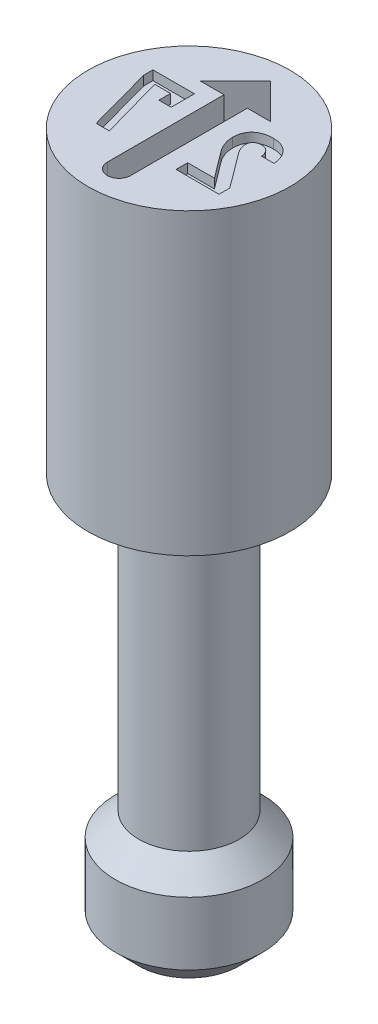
ISO-10303-21;
HEADER;
FILE_DESCRIPTION(('STEP AP214'),'2;1');
FILE_NAME('part.step','',(''),(''),'','','');
FILE_SCHEMA(('AUTOMOTIVE_DESIGN { 1 0 10303 214 1 1 1 1 }'));
ENDSEC;
DATA;
#1=APPLICATION_CONTEXT('core data for automotive mechanical design processes');
#2=APPLICATION_PROTOCOL_DEFINITION('international standard','automotive_design',2000,#1);
#3=PRODUCT_CONTEXT('',#1,'mechanical');
#4=PRODUCT('Part','Part','',(#3));
#5=PRODUCT_RELATED_PRODUCT_CATEGORY('part','',(#4));
#6=PRODUCT_DEFINITION_FORMATION('','',#4);
#7=PRODUCT_DEFINITION_CONTEXT('part definition',#1,'design');
#8=PRODUCT_DEFINITION('design','',#6,#7);
#9=PRODUCT_DEFINITION_SHAPE('','',#8);
#10=(LENGTH_UNIT() NAMED_UNIT(*) SI_UNIT(.MILLI.,.METRE.));
#11=(NAMED_UNIT(*) PLANE_ANGLE_UNIT() SI_UNIT($,.RADIAN.));
#12=(NAMED_UNIT(*) SI_UNIT($,.STERADIAN.) SOLID_ANGLE_UNIT());
#13=UNCERTAINTY_MEASURE_WITH_UNIT(LENGTH_MEASURE(1.E-05),#10,'distance_accuracy_value','');
#14=(GEOMETRIC_REPRESENTATION_CONTEXT(3) GLOBAL_UNCERTAINTY_ASSIGNED_CONTEXT((#13)) GLOBAL_UNIT_ASSIGNED_CONTEXT((#10,
#11,#12)) REPRESENTATION_CONTEXT('',''));
#15=CARTESIAN_POINT('',(0.,0.,0.));
#16=DIRECTION('',(0.,0.,1.));
#17=DIRECTION('',(1.,0.,0.));
#18=AXIS2_PLACEMENT_3D('',#15,#16,#17);
#19=CARTESIAN_POINT('',(0.,7.62,0.));
#20=DIRECTION('',(0.,1.,0.));
#21=DIRECTION('',(0.,0.,1.));
#22=AXIS2_PLACEMENT_3D('',#19,#20,#21);
#23=PLANE('',#22);
#24=DIRECTION('',(1.,0.,0.));
#25=VECTOR('',#24,1.);
#26=CARTESIAN_POINT('',(0.316223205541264,7.62,0.4572));
#27=LINE('',#26,#25);
#28=CARTESIAN_POINT('',(0.316223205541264,7.62,0.4572));
#29=VERTEX_POINT('',#28);
#30=CARTESIAN_POINT('',(0.783814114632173,7.62,0.4572));
#31=VERTEX_POINT('',#30);
#32=EDGE_CURVE('E51',#29,#31,#27,.T.);
#33=ORIENTED_EDGE('',*,*,#32,.F.);
#34=DIRECTION('',(0.,0.,1.));
#35=VECTOR('',#34,1.);
#36=CARTESIAN_POINT('',(0.316223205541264,7.62,0.33052987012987));
#37=LINE('',#36,#35);
#38=CARTESIAN_POINT('',(0.316223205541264,7.62,0.33052987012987));
#39=VERTEX_POINT('',#38);
#40=EDGE_CURVE('E272',#39,#29,#37,.T.);
#41=ORIENTED_EDGE('',*,*,#40,.F.);
#42=DIRECTION('',(-1.,0.,0.));
#43=VECTOR('',#42,1.);
#44=CARTESIAN_POINT('',(0.607333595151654,7.62,0.33052987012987));
#45=LINE('',#44,#43);
#46=CARTESIAN_POINT('',(0.607333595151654,7.62,0.33052987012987));
#47=VERTEX_POINT('',#46);
#48=EDGE_CURVE('E275',#47,#39,#45,.T.);
#49=ORIENTED_EDGE('',*,*,#48,.F.);
#50=DIRECTION('',(0.601464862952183,0.,0.798899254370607));
#51=VECTOR('',#50,1.);
#52=CARTESIAN_POINT('',(0.390773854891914,7.62,0.0428831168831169));
#53=LINE('',#52,#51);
#54=CARTESIAN_POINT('',(0.390773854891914,7.62,0.0428831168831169));
#55=VERTEX_POINT('',#54);
#56=EDGE_CURVE('E587',#55,#47,#53,.T.);
#57=ORIENTED_EDGE('',*,*,#56,.F.);
#58=CARTESIAN_POINT('',(0.320676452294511,7.62,-0.15272987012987));
#59=CARTESIAN_POINT('',(0.320892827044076,7.62,-0.14441466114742));
#60=CARTESIAN_POINT('',(0.321327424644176,7.62,-0.12771322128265));
#61=CARTESIAN_POINT('',(0.325085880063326,7.62,-0.102584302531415));
#62=CARTESIAN_POINT('',(0.330513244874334,7.62,-0.0771943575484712));
#63=CARTESIAN_POINT('',(0.33876293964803,7.62,-0.0519096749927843));
#64=CARTESIAN_POINT('',(0.348698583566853,7.62,-0.0268740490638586));
#65=CARTESIAN_POINT('',(0.360812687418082,7.62,-0.00265805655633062));
#66=CARTESIAN_POINT('',(0.374637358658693,7.62,0.0208100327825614));
#67=CARTESIAN_POINT('',(0.385369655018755,7.62,0.0354907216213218));
#68=CARTESIAN_POINT('',(0.390773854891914,7.62,0.0428831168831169));
#69=B_SPLINE_CURVE_WITH_KNOTS('',3,(#58,#59,#60,#61,#62,#63,#64,#65,#66,#67,#68),.UNSPECIFIED.,
.F.,.F.,(4,1,1,1,1,1,1,1,4),(0.,0.117962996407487,0.236933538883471,0.360005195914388,
0.486119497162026,0.61393177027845,0.742012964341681,0.870091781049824,1.),.UNSPECIFIED.);
#70=CARTESIAN_POINT('',(0.320676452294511,7.62,-0.15272987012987));
#71=VERTEX_POINT('',#70);
#72=EDGE_CURVE('E590',#71,#55,#69,.T.);
#73=ORIENTED_EDGE('',*,*,#72,.F.);
#74=DIRECTION('',(0.,0.,1.));
#75=VECTOR('',#74,1.);
#76=CARTESIAN_POINT('',(0.320676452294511,7.62,-0.153224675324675));
#77=LINE('',#76,#75);
#78=CARTESIAN_POINT('',(0.320676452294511,7.62,-0.153224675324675));
#79=VERTEX_POINT('',#78);
#80=EDGE_CURVE('E595',#79,#71,#77,.T.);
#81=ORIENTED_EDGE('',*,*,#80,.F.);
#82=CARTESIAN_POINT('',(0.554389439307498,7.62,-0.366155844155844));
#83=CARTESIAN_POINT('',(0.545310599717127,7.62,-0.366023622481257));
#84=CARTESIAN_POINT('',(0.527661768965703,7.62,-0.365766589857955));
#85=CARTESIAN_POINT('',(0.502033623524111,7.62,-0.363031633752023));
#86=CARTESIAN_POINT('',(0.47796178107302,7.62,-0.358831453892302));
#87=CARTESIAN_POINT('',(0.455466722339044,7.62,-0.352765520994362));
#88=CARTESIAN_POINT('',(0.434593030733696,7.62,-0.344832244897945));
#89=CARTESIAN_POINT('',(0.415321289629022,7.62,-0.335199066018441));
#90=CARTESIAN_POINT('',(0.397525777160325,7.62,-0.324006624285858));
#91=CARTESIAN_POINT('',(0.381470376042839,7.62,-0.31087541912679));
#92=CARTESIAN_POINT('',(0.367132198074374,7.62,-0.29622594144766));
#93=CARTESIAN_POINT('',(0.354587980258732,7.62,-0.280112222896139));
#94=CARTESIAN_POINT('',(0.344233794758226,7.62,-0.262394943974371));
#95=CARTESIAN_POINT('',(0.335329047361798,7.62,-0.243431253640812));
#96=CARTESIAN_POINT('',(0.328883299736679,7.62,-0.222809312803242));
#97=CARTESIAN_POINT('',(0.324031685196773,7.62,-0.200915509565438));
#98=CARTESIAN_POINT('',(0.321255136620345,7.62,-0.177541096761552));
#99=CARTESIAN_POINT('',(0.320872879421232,7.61999999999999,-0.161478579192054));
#100=CARTESIAN_POINT('',(0.320676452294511,7.62,-0.153224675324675));
#101=B_SPLINE_CURVE_WITH_KNOTS('',3,(#82,#83,#84,#85,#86,#87,#88,#89,#90,#91,#92,#93,#94,#95,
#96,#97,#98,#99,#100),.UNSPECIFIED.,.F.,.F.,(4,1,1,1,1,1,1,1,1,1,1,1,1,1,1,1,4),(0.,
0.0757177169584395,0.147191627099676,0.214761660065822,0.279410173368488,0.341256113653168,
0.400743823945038,0.458895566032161,0.516277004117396,0.573364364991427,0.62960517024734,
0.686164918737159,0.744246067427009,0.804009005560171,0.865999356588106,0.931142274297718,1.),.UNSPECIFIED.);
#102=CARTESIAN_POINT('',(0.554389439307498,7.62,-0.366155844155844));
#103=VERTEX_POINT('',#102);
#104=EDGE_CURVE('E601',#103,#79,#101,.T.);
#105=ORIENTED_EDGE('',*,*,#104,.F.);
#106=CARTESIAN_POINT('',(0.793710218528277,7.62,-0.133432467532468));
#107=CARTESIAN_POINT('',(0.792655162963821,7.62,-0.142473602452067));
#108=CARTESIAN_POINT('',(0.79059588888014,7.62,-0.160120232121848));
#109=CARTESIAN_POINT('',(0.784994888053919,7.62,-0.185549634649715));
#110=CARTESIAN_POINT('',(0.778141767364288,7.62,-0.209463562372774));
#111=CARTESIAN_POINT('',(0.769556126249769,7.62,-0.23183055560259));
#112=CARTESIAN_POINT('',(0.759310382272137,7.62,-0.252618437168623));
#113=CARTESIAN_POINT('',(0.74763335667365,7.62,-0.271980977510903));
#114=CARTESIAN_POINT('',(0.733942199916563,7.62,-0.289452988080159));
#115=CARTESIAN_POINT('',(0.719002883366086,7.62,-0.305556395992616));
#116=CARTESIAN_POINT('',(0.702432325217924,7.62,-0.319709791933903));
#117=CARTESIAN_POINT('',(0.684711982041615,7.62,-0.332152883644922));
#118=CARTESIAN_POINT('',(0.665845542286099,7.62,-0.342776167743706));
#119=CARTESIAN_POINT('',(0.645771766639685,7.62,-0.351392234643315));
#120=CARTESIAN_POINT('',(0.624521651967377,7.62,-0.357950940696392));
#121=CARTESIAN_POINT('',(0.602179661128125,7.62,-0.362763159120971));
#122=CARTESIAN_POINT('',(0.578651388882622,7.62,-0.365569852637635));
#123=CARTESIAN_POINT('',(0.562588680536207,7.62,-0.365957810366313));
#124=CARTESIAN_POINT('',(0.554389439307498,7.62,-0.366155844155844));
#125=B_SPLINE_CURVE_WITH_KNOTS('',3,(#106,#107,#108,#109,#110,#111,#112,#113,#114,#115,#116,
#117,#118,#119,#120,#121,#122,#123,#124),.UNSPECIFIED.,.F.,.F.,(4,1,1,1,1,1,1,1,1,1,1,1,1,1,1,1,
4),(0.,0.0735286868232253,0.143514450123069,0.210169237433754,0.274454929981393,
0.336856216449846,0.397291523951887,0.456843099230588,0.515945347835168,0.574554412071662,
0.632618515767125,0.690713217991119,0.749236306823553,0.808827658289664,0.870185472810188,
0.9337359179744,1.),.UNSPECIFIED.);
#126=CARTESIAN_POINT('',(0.793710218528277,7.62,-0.133432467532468));
#127=VERTEX_POINT('',#126);
#128=EDGE_CURVE('E606',#127,#103,#125,.T.);
#129=ORIENTED_EDGE('',*,*,#128,.F.);
#130=DIRECTION('',(0.,0.,-1.));
#131=VECTOR('',#130,1.);
#132=CARTESIAN_POINT('',(0.793710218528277,7.62,-0.132937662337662));
#133=LINE('',#132,#131);
#134=CARTESIAN_POINT('',(0.793710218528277,7.62,-0.132937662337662));
#135=VERTEX_POINT('',#134);
#136=EDGE_CURVE('E614',#135,#127,#133,.T.);
#137=ORIENTED_EDGE('',*,*,#136,.F.);
#138=DIRECTION('',(1.,0.,0.));
#139=VECTOR('',#138,1.);
#140=CARTESIAN_POINT('',(0.656814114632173,7.62,-0.132937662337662));
#141=LINE('',#140,#139);
#142=CARTESIAN_POINT('',(0.656814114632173,7.62,-0.132937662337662));
#143=VERTEX_POINT('',#142);
#144=EDGE_CURVE('E620',#143,#135,#141,.T.);
#145=ORIENTED_EDGE('',*,*,#144,.F.);
#146=DIRECTION('',(0.,0.,1.));
#147=VECTOR('',#146,1.);
#148=CARTESIAN_POINT('',(0.656814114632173,7.62,-0.133432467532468));
#149=LINE('',#148,#147);
#150=CARTESIAN_POINT('',(0.656814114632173,7.62,-0.133432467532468));
#151=VERTEX_POINT('',#150);
#152=EDGE_CURVE('E623',#151,#143,#149,.T.);
#153=ORIENTED_EDGE('',*,*,#152,.F.);
#154=CARTESIAN_POINT('',(0.553234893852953,7.62,-0.239485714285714));
#155=CARTESIAN_POINT('',(0.560094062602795,7.62,-0.239229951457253));
#156=CARTESIAN_POINT('',(0.573375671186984,7.62,-0.238734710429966));
#157=CARTESIAN_POINT('',(0.592228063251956,7.62,-0.233139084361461));
#158=CARTESIAN_POINT('',(0.609319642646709,7.62,-0.224541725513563));
#159=CARTESIAN_POINT('',(0.624047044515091,7.62,-0.212118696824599));
#160=CARTESIAN_POINT('',(0.636425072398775,7.62,-0.196633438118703));
#161=CARTESIAN_POINT('',(0.646237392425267,7.62,-0.178206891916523));
#162=CARTESIAN_POINT('',(0.653107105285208,7.62,-0.15678642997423));
#163=CARTESIAN_POINT('',(0.655541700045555,7.62,-0.141448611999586));
#164=CARTESIAN_POINT('',(0.656814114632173,7.62,-0.133432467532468));
#165=B_SPLINE_CURVE_WITH_KNOTS('',3,(#154,#155,#156,#157,#158,#159,#160,#161,#162,#163,#164),
.UNSPECIFIED.,.F.,.F.,(4,1,1,1,1,1,1,1,4),(0.,0.124986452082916,0.242014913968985,
0.3561482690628,0.472436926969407,0.591058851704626,0.716468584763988,0.851815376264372,1.),.UNSPECIFIED.);
#166=CARTESIAN_POINT('',(0.553234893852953,7.62,-0.239485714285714));
#167=VERTEX_POINT('',#166);
#168=EDGE_CURVE('E626',#167,#151,#165,.T.);
#169=ORIENTED_EDGE('',*,*,#168,.F.);
#170=CARTESIAN_POINT('',(0.45806736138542,7.62,-0.153224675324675));
#171=CARTESIAN_POINT('',(0.458289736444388,7.62,-0.159747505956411));
#172=CARTESIAN_POINT('',(0.458714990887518,7.62,-0.172221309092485));
#173=CARTESIAN_POINT('',(0.463647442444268,7.62,-0.189681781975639));
#174=CARTESIAN_POINT('',(0.471487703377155,7.62,-0.204874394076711));
#175=CARTESIAN_POINT('',(0.482667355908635,7.62,-0.217445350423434));
#176=CARTESIAN_POINT('',(0.496576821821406,7.62,-0.227449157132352));
#177=CARTESIAN_POINT('',(0.51319509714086,7.62,-0.234666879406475));
#178=CARTESIAN_POINT('',(0.532432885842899,7.62,-0.238644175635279));
#179=CARTESIAN_POINT('',(0.546069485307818,7.62,-0.239195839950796));
#180=CARTESIAN_POINT('',(0.553234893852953,7.62,-0.239485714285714));
#181=B_SPLINE_CURVE_WITH_KNOTS('',3,(#170,#171,#172,#173,#174,#175,#176,#177,#178,#179,#180),
.UNSPECIFIED.,.F.,.F.,(4,1,1,1,1,1,1,1,4),(0.,0.133827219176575,0.255921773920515,
0.369738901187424,0.482715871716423,0.598532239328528,0.719553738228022,0.852638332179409,1.),.UNSPECIFIED.);
#182=CARTESIAN_POINT('',(0.45806736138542,7.62,-0.153224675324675));
#183=VERTEX_POINT('',#182);
#184=EDGE_CURVE('E631',#183,#167,#181,.T.);
#185=ORIENTED_EDGE('',*,*,#184,.F.);
#186=DIRECTION('',(0.,0.,-1.));
#187=VECTOR('',#186,1.);
#188=CARTESIAN_POINT('',(0.45806736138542,7.62,-0.15207012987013));
#189=LINE('',#188,#187);
#190=CARTESIAN_POINT('',(0.45806736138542,7.62,-0.15207012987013));
#191=VERTEX_POINT('',#190);
#192=EDGE_CURVE('E639',#191,#183,#189,.T.);
#193=ORIENTED_EDGE('',*,*,#192,.F.);
#194=CARTESIAN_POINT('',(0.503754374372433,7.62,-0.035461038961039));
#195=CARTESIAN_POINT('',(0.500288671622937,7.62,-0.0402595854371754));
#196=CARTESIAN_POINT('',(0.493454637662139,7.62,-0.0497218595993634));
#197=CARTESIAN_POINT('',(0.48430969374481,7.62,-0.0644336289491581));
#198=CARTESIAN_POINT('',(0.47660604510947,7.62,-0.0794885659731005));
#199=CARTESIAN_POINT('',(0.469962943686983,7.62,-0.0946085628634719));
#200=CARTESIAN_POINT('',(0.464759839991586,7.62,-0.109618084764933));
#201=CARTESIAN_POINT('',(0.46082874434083,7.62,-0.124199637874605));
#202=CARTESIAN_POINT('',(0.458660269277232,7.62,-0.138315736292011));
#203=CARTESIAN_POINT('',(0.458261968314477,7.62,-0.147555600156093));
#204=CARTESIAN_POINT('',(0.45806736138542,7.62,-0.15207012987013));
#205=B_SPLINE_CURVE_WITH_KNOTS('',3,(#194,#195,#196,#197,#198,#199,#200,#201,#202,#203,#204),
.UNSPECIFIED.,.F.,.F.,(4,1,1,1,1,1,1,1,4),(0.,0.139527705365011,0.275135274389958,
0.407888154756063,0.537917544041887,0.66417107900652,0.782063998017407,0.893518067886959,1.),.UNSPECIFIED.);
#206=CARTESIAN_POINT('',(0.503754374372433,7.62,-0.035461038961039));
#207=VERTEX_POINT('',#206);
#208=EDGE_CURVE('E645',#207,#191,#205,.T.);
#209=ORIENTED_EDGE('',*,*,#208,.F.);
#210=DIRECTION('',(-0.597969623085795,0.,-0.801518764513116));
#211=VECTOR('',#210,1.);
#212=CARTESIAN_POINT('',(0.783814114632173,7.62,0.339931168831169));
#213=LINE('',#212,#211);
#214=CARTESIAN_POINT('',(0.783814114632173,7.62,0.339931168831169));
#215=VERTEX_POINT('',#214);
#216=EDGE_CURVE('E650',#215,#207,#213,.T.);
#217=ORIENTED_EDGE('',*,*,#216,.F.);
#218=DIRECTION('',(0.,0.,-1.));
#219=VECTOR('',#218,1.);
#220=CARTESIAN_POINT('',(0.783814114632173,7.62,0.4572));
#221=LINE('',#220,#219);
#222=EDGE_CURVE('E656',#31,#215,#221,.T.);
#223=ORIENTED_EDGE('',*,*,#222,.F.);
#224=EDGE_LOOP('',(#33,#41,#49,#57,#73,#81,#105,#129,#137,#145,#153,#169,#185,#193,#209,#217,#223));
#225=FACE_BOUND('',#224,.T.);
#226=DIRECTION('',(-1.,0.,0.));
#227=VECTOR('',#226,1.);
#228=CARTESIAN_POINT('',(-0.296708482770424,7.62,-0.3556));
#229=LINE('',#228,#227);
#230=CARTESIAN_POINT('',(-0.296708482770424,7.62,-0.3556));
#231=VERTEX_POINT('',#230);
#232=CARTESIAN_POINT('',(-0.748135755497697,7.62,-0.3556));
#233=VERTEX_POINT('',#232);
#234=EDGE_CURVE('E59',#231,#233,#229,.T.);
#235=ORIENTED_EDGE('',*,*,#234,.F.);
#236=DIRECTION('',(0.,0.,-1.));
#237=VECTOR('',#236,1.);
#238=CARTESIAN_POINT('',(-0.296708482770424,7.62,-0.10225974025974));
#239=LINE('',#238,#237);
#240=CARTESIAN_POINT('',(-0.296708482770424,7.62,-0.10225974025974));
#241=VERTEX_POINT('',#240);
#242=EDGE_CURVE('E504',#241,#231,#239,.T.);
#243=ORIENTED_EDGE('',*,*,#242,.F.);
#244=DIRECTION('',(1.,0.,0.));
#245=VECTOR('',#244,1.);
#246=CARTESIAN_POINT('',(-0.429646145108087,7.62,-0.10225974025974));
#247=LINE('',#246,#245);
#248=CARTESIAN_POINT('',(-0.429646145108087,7.62,-0.10225974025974));
#249=VERTEX_POINT('',#248);
#250=EDGE_CURVE('E508',#249,#241,#247,.T.);
#251=ORIENTED_EDGE('',*,*,#250,.F.);
#252=DIRECTION('',(0.,0.,1.));
#253=VECTOR('',#252,1.);
#254=CARTESIAN_POINT('',(-0.429646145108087,7.62,-0.22892987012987));
#255=LINE('',#254,#253);
#256=CARTESIAN_POINT('',(-0.429646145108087,7.62,-0.22892987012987));
#257=VERTEX_POINT('',#256);
#258=EDGE_CURVE('E511',#257,#249,#255,.T.);
#259=ORIENTED_EDGE('',*,*,#258,.F.);
#260=DIRECTION('',(1.,0.,0.));
#261=VECTOR('',#260,1.);
#262=CARTESIAN_POINT('',(-0.602168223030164,7.62,-0.22892987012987));
#263=LINE('',#262,#261);
#264=CARTESIAN_POINT('',(-0.602168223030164,7.62,-0.22892987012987));
#265=VERTEX_POINT('',#264);
#266=EDGE_CURVE('E514',#265,#257,#263,.T.);
#267=ORIENTED_EDGE('',*,*,#266,.F.);
#268=DIRECTION('',(-0.270102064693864,0.,-0.962831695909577));
#269=VECTOR('',#268,1.);
#270=CARTESIAN_POINT('',(-0.409689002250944,7.62,0.4572));
#271=LINE('',#270,#269);
#272=CARTESIAN_POINT('',(-0.409689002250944,7.62,0.4572));
#273=VERTEX_POINT('',#272);
#274=EDGE_CURVE('E517',#273,#265,#271,.T.);
#275=ORIENTED_EDGE('',*,*,#274,.F.);
#276=DIRECTION('',(1.,0.,0.));
#277=VECTOR('',#276,1.);
#278=CARTESIAN_POINT('',(-0.552687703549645,7.62,0.4572));
#279=LINE('',#278,#277);
#280=CARTESIAN_POINT('',(-0.552687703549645,7.62,0.4572));
#281=VERTEX_POINT('',#280);
#282=EDGE_CURVE('E520',#281,#273,#279,.T.);
#283=ORIENTED_EDGE('',*,*,#282,.F.);
#284=DIRECTION('',(0.264647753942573,0.,0.964345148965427));
#285=VECTOR('',#284,1.);
#286=CARTESIAN_POINT('',(-0.748135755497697,7.62,-0.25498961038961));
#287=LINE('',#286,#285);
#288=CARTESIAN_POINT('',(-0.748135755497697,7.62,-0.25498961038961));
#289=VERTEX_POINT('',#288);
#290=EDGE_CURVE('E523',#289,#281,#287,.T.);
#291=ORIENTED_EDGE('',*,*,#290,.F.);
#292=DIRECTION('',(0.,0.,1.));
#293=VECTOR('',#292,1.);
#294=CARTESIAN_POINT('',(-0.748135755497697,7.62,-0.3556));
#295=LINE('',#294,#293);
#296=EDGE_CURVE('E526',#233,#289,#295,.T.);
#297=ORIENTED_EDGE('',*,*,#296,.F.);
#298=EDGE_LOOP('',(#235,#243,#251,#259,#267,#275,#283,#291,#297));
#299=FACE_BOUND('',#298,.T.);
#300=CARTESIAN_POINT('',(0.,7.62,0.762));
#301=DIRECTION('',(0.,1.,0.));
#302=DIRECTION('',(0.,0.,1.));
#303=AXIS2_PLACEMENT_3D('',#300,#301,#302);
#304=CIRCLE('',#303,0.127);
#305=CARTESIAN_POINT('',(-0.127,7.62,0.762));
#306=VERTEX_POINT('',#305);
#307=CARTESIAN_POINT('',(0.127,7.62,0.762));
#308=VERTEX_POINT('',#307);
#309=EDGE_CURVE('E463',#306,#308,#304,.T.);
#310=ORIENTED_EDGE('',*,*,#309,.F.);
#311=DIRECTION('',(0.,0.,1.));
#312=VECTOR('',#311,1.);
#313=CARTESIAN_POINT('',(-0.127,7.62,0.762));
#314=LINE('',#313,#312);
#315=CARTESIAN_POINT('',(-0.127,7.62,-0.508));
#316=VERTEX_POINT('',#315);
#317=EDGE_CURVE('E444',#316,#306,#314,.T.);
#318=ORIENTED_EDGE('',*,*,#317,.F.);
#319=DIRECTION('',(1.,0.,0.));
#320=VECTOR('',#319,1.);
#321=CARTESIAN_POINT('',(-0.127,7.62,-0.508));
#322=LINE('',#321,#320);
#323=CARTESIAN_POINT('',(-0.381,7.62,-0.508));
#324=VERTEX_POINT('',#323);
#325=EDGE_CURVE('E448',#324,#316,#322,.T.);
#326=ORIENTED_EDGE('',*,*,#325,.F.);
#327=DIRECTION('',(-0.707106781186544,0.,0.707106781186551));
#328=VECTOR('',#327,1.);
#329=CARTESIAN_POINT('',(0.,7.62,-0.889000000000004));
#330=LINE('',#329,#328);
#331=CARTESIAN_POINT('',(0.,7.62,-0.889000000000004));
#332=VERTEX_POINT('',#331);
#333=EDGE_CURVE('E451',#332,#324,#330,.T.);
#334=ORIENTED_EDGE('',*,*,#333,.F.);
#335=DIRECTION('',(-0.707106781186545,0.,-0.70710678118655));
#336=VECTOR('',#335,1.);
#337=CARTESIAN_POINT('',(0.381,7.62,-0.508000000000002));
#338=LINE('',#337,#336);
#339=CARTESIAN_POINT('',(0.381,7.62,-0.508000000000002));
#340=VERTEX_POINT('',#339);
#341=EDGE_CURVE('E454',#340,#332,#338,.T.);
#342=ORIENTED_EDGE('',*,*,#341,.F.);
#343=DIRECTION('',(1.,0.,0.));
#344=VECTOR('',#343,1.);
#345=CARTESIAN_POINT('',(0.127,7.62,-0.508));
#346=LINE('',#345,#344);
#347=CARTESIAN_POINT('',(0.127,7.62,-0.508));
#348=VERTEX_POINT('',#347);
#349=EDGE_CURVE('E457',#348,#340,#346,.T.);
#350=ORIENTED_EDGE('',*,*,#349,.F.);
#351=DIRECTION('',(0.,0.,-1.));
#352=VECTOR('',#351,1.);
#353=CARTESIAN_POINT('',(0.127,7.62,0.762));
#354=LINE('',#353,#352);
#355=EDGE_CURVE('E460',#308,#348,#354,.T.);
#356=ORIENTED_EDGE('',*,*,#355,.F.);
#357=EDGE_LOOP('',(#310,#318,#326,#334,#342,#350,#356));
#358=FACE_BOUND('',#357,.T.);
#359=CARTESIAN_POINT('',(0.,7.62,0.));
#360=DIRECTION('',(0.,-1.,0.));
#361=DIRECTION('',(0.,0.,-1.));
#362=AXIS2_PLACEMENT_3D('',#359,#360,#361);
#363=CIRCLE('',#362,1.09855);
#364=CARTESIAN_POINT('',(0.,7.62,-1.09855));
#365=VERTEX_POINT('',#364);
#366=EDGE_CURVE('E11',#365,#365,#363,.T.);
#367=ORIENTED_EDGE('',*,*,#366,.F.);
#368=EDGE_LOOP('',(#367));
#369=FACE_BOUND('',#368,.T.);
#370=ADVANCED_FACE('F37',(#225,#299,#358,#369),#23,.T.);
#371=CARTESIAN_POINT('',(0.,0.,0.));
#372=DIRECTION('',(0.,-1.,0.));
#373=DIRECTION('',(0.,0.,-1.));
#374=AXIS2_PLACEMENT_3D('',#371,#372,#373);
#375=CYLINDRICAL_SURFACE('',#374,1.09855);
#376=ORIENTED_EDGE('',*,*,#366,.T.);
#377=EDGE_LOOP('',(#376));
#378=FACE_BOUND('',#377,.T.);
#379=CARTESIAN_POINT('',(0.,4.3688,0.));
#380=DIRECTION('',(0.,-1.,0.));
#381=DIRECTION('',(0.,0.,-1.));
#382=AXIS2_PLACEMENT_3D('',#379,#380,#381);
#383=CIRCLE('',#382,1.09855);
#384=CARTESIAN_POINT('',(0.,4.3688,-1.09855));
#385=VERTEX_POINT('',#384);
#386=EDGE_CURVE('E44',#385,#385,#383,.T.);
#387=ORIENTED_EDGE('',*,*,#386,.F.);
#388=EDGE_LOOP('',(#387));
#389=FACE_BOUND('',#388,.T.);
#390=ADVANCED_FACE('F400',(#378,#389),#375,.T.);
#391=CARTESIAN_POINT('',(1.09855,4.3688,0.));
#392=DIRECTION('',(0.,-1.,0.));
#393=DIRECTION('',(0.,0.,-1.));
#394=AXIS2_PLACEMENT_3D('',#391,#392,#393);
#395=PLANE('',#394);
#396=ORIENTED_EDGE('',*,*,#386,.T.);
#397=EDGE_LOOP('',(#396));
#398=FACE_BOUND('',#397,.T.);
#399=CARTESIAN_POINT('',(0.,4.3688,0.));
#400=DIRECTION('',(0.,-1.,0.));
#401=DIRECTION('',(0.,0.,-1.));
#402=AXIS2_PLACEMENT_3D('',#399,#400,#401);
#403=CIRCLE('',#402,0.5461);
#404=CARTESIAN_POINT('',(0.,4.3688,-0.5461));
#405=VERTEX_POINT('',#404);
#406=EDGE_CURVE('E412',#405,#405,#403,.T.);
#407=ORIENTED_EDGE('',*,*,#406,.F.);
#408=EDGE_LOOP('',(#407));
#409=FACE_BOUND('',#408,.T.);
#410=ADVANCED_FACE('F397',(#398,#409),#395,.T.);
#411=CARTESIAN_POINT('',(0.,0.,0.));
#412=DIRECTION('',(0.,-1.,0.));
#413=DIRECTION('',(0.,0.,-1.));
#414=AXIS2_PLACEMENT_3D('',#411,#412,#413);
#415=CYLINDRICAL_SURFACE('',#414,0.5461);
#416=ORIENTED_EDGE('',*,*,#406,.T.);
#417=EDGE_LOOP('',(#416));
#418=FACE_BOUND('',#417,.T.);
#419=CARTESIAN_POINT('',(0.,1.1938,0.));
#420=DIRECTION('',(0.,-1.,0.));
#421=DIRECTION('',(0.,0.,-1.));
#422=AXIS2_PLACEMENT_3D('',#419,#420,#421);
#423=CIRCLE('',#422,0.5461);
#424=CARTESIAN_POINT('',(0.,1.1938,-0.5461));
#425=VERTEX_POINT('',#424);
#426=EDGE_CURVE('E414',#425,#425,#423,.T.);
#427=ORIENTED_EDGE('',*,*,#426,.F.);
#428=EDGE_LOOP('',(#427));
#429=FACE_BOUND('',#428,.T.);
#430=ADVANCED_FACE('F393',(#418,#429),#415,.T.);
#431=CARTESIAN_POINT('',(0.,0.939900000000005,0.));
#432=DIRECTION('',(0.,-1.,0.));
#433=DIRECTION('',(0.,0.,-1.));
#434=AXIS2_PLACEMENT_3D('',#431,#432,#433);
#435=CONICAL_SURFACE('',#434,0.8,0.785398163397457);
#436=ORIENTED_EDGE('',*,*,#426,.T.);
#437=EDGE_LOOP('',(#436));
#438=FACE_BOUND('',#437,.T.);
#439=CARTESIAN_POINT('',(0.,0.939900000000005,0.));
#440=DIRECTION('',(0.,-1.,0.));
#441=DIRECTION('',(0.,0.,-1.));
#442=AXIS2_PLACEMENT_3D('',#439,#440,#441);
#443=CIRCLE('',#442,0.8);
#444=CARTESIAN_POINT('',(0.,0.939900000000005,-0.8));
#445=VERTEX_POINT('',#444);
#446=EDGE_CURVE('E419',#445,#445,#443,.T.);
#447=ORIENTED_EDGE('',*,*,#446,.F.);
#448=EDGE_LOOP('',(#447));
#449=FACE_BOUND('',#448,.T.);
#450=ADVANCED_FACE('F389',(#438,#449),#435,.T.);
#451=CARTESIAN_POINT('',(0.,0.,0.));
#452=DIRECTION('',(0.,-1.,0.));
#453=DIRECTION('',(0.,0.,-1.));
#454=AXIS2_PLACEMENT_3D('',#451,#452,#453);
#455=CYLINDRICAL_SURFACE('',#454,0.8);
#456=ORIENTED_EDGE('',*,*,#446,.T.);
#457=EDGE_LOOP('',(#456));
#458=FACE_BOUND('',#457,.T.);
#459=CARTESIAN_POINT('',(0.,0.254,0.));
#460=DIRECTION('',(0.,-1.,0.));
#461=DIRECTION('',(0.,0.,-1.));
#462=AXIS2_PLACEMENT_3D('',#459,#460,#461);
#463=CIRCLE('',#462,0.8);
#464=CARTESIAN_POINT('',(0.,0.254,-0.8));
#465=VERTEX_POINT('',#464);
#466=EDGE_CURVE('E422',#465,#465,#463,.T.);
#467=ORIENTED_EDGE('',*,*,#466,.F.);
#468=EDGE_LOOP('',(#467));
#469=FACE_BOUND('',#468,.T.);
#470=ADVANCED_FACE('F385',(#458,#469),#455,.T.);
#471=CARTESIAN_POINT('',(0.,0.,0.));
#472=DIRECTION('',(0.,1.,0.));
#473=DIRECTION('',(0.,0.,1.));
#474=AXIS2_PLACEMENT_3D('',#471,#472,#473);
#475=CONICAL_SURFACE('',#474,0.546000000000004,0.78539816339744);
#476=ORIENTED_EDGE('',*,*,#466,.T.);
#477=EDGE_LOOP('',(#476));
#478=FACE_BOUND('',#477,.T.);
#479=CARTESIAN_POINT('',(0.,0.,0.));
#480=DIRECTION('',(0.,-1.,0.));
#481=DIRECTION('',(0.,0.,-1.));
#482=AXIS2_PLACEMENT_3D('',#479,#480,#481);
#483=CIRCLE('',#482,0.546000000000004);
#484=CARTESIAN_POINT('',(0.,0.,-0.546000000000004));
#485=VERTEX_POINT('',#484);
#486=EDGE_CURVE('E425',#485,#485,#483,.T.);
#487=ORIENTED_EDGE('',*,*,#486,.F.);
#488=EDGE_LOOP('',(#487));
#489=FACE_BOUND('',#488,.T.);
#490=ADVANCED_FACE('F381',(#478,#489),#475,.T.);
#491=CARTESIAN_POINT('',(0.546000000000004,0.,0.));
#492=DIRECTION('',(0.,-1.,0.));
#493=DIRECTION('',(0.,0.,-1.));
#494=AXIS2_PLACEMENT_3D('',#491,#492,#493);
#495=PLANE('',#494);
#496=ORIENTED_EDGE('',*,*,#486,.T.);
#497=EDGE_LOOP('',(#496));
#498=FACE_BOUND('',#497,.T.);
#499=ADVANCED_FACE('F377',(#498),#495,.T.);
#500=CARTESIAN_POINT('',(0.,7.2136,0.762));
#501=DIRECTION('',(0.,1.,0.));
#502=DIRECTION('',(0.,0.,1.));
#503=AXIS2_PLACEMENT_3D('',#500,#501,#502);
#504=CYLINDRICAL_SURFACE('',#503,0.127);
#505=ORIENTED_EDGE('',*,*,#309,.T.);
#506=DIRECTION('',(0.,1.,0.));
#507=VECTOR('',#506,1.);
#508=CARTESIAN_POINT('',(0.127,7.2136,0.762));
#509=LINE('',#508,#507);
#510=CARTESIAN_POINT('',(0.127,7.2136,0.762));
#511=VERTEX_POINT('',#510);
#512=EDGE_CURVE('E429',#511,#308,#509,.T.);
#513=ORIENTED_EDGE('',*,*,#512,.F.);
#514=CARTESIAN_POINT('',(0.,7.2136,0.762));
#515=DIRECTION('',(0.,1.,0.));
#516=DIRECTION('',(0.,0.,1.));
#517=AXIS2_PLACEMENT_3D('',#514,#515,#516);
#518=CIRCLE('',#517,0.127);
#519=CARTESIAN_POINT('',(-0.127,7.2136,0.762));
#520=VERTEX_POINT('',#519);
#521=EDGE_CURVE('E447',#520,#511,#518,.T.);
#522=ORIENTED_EDGE('',*,*,#521,.F.);
#523=DIRECTION('',(0.,1.,0.));
#524=VECTOR('',#523,1.);
#525=CARTESIAN_POINT('',(-0.127,7.2136,0.762));
#526=LINE('',#525,#524);
#527=EDGE_CURVE('E428',#520,#306,#526,.T.);
#528=ORIENTED_EDGE('',*,*,#527,.T.);
#529=EDGE_LOOP('',(#505,#513,#522,#528));
#530=FACE_BOUND('',#529,.T.);
#531=ADVANCED_FACE('F355',(#530),#504,.F.);
#532=CARTESIAN_POINT('',(-0.127,7.2136,0.762));
#533=DIRECTION('',(-1.,0.,0.));
#534=DIRECTION('',(0.,0.,1.));
#535=AXIS2_PLACEMENT_3D('',#532,#533,#534);
#536=PLANE('',#535);
#537=ORIENTED_EDGE('',*,*,#317,.T.);
#538=ORIENTED_EDGE('',*,*,#527,.F.);
#539=DIRECTION('',(0.,0.,1.));
#540=VECTOR('',#539,1.);
#541=CARTESIAN_POINT('',(-0.127,7.2136,0.762));
#542=LINE('',#541,#540);
#543=CARTESIAN_POINT('',(-0.127,7.2136,-0.508));
#544=VERTEX_POINT('',#543);
#545=EDGE_CURVE('E433',#544,#520,#542,.T.);
#546=ORIENTED_EDGE('',*,*,#545,.F.);
#547=DIRECTION('',(0.,1.,0.));
#548=VECTOR('',#547,1.);
#549=CARTESIAN_POINT('',(-0.127,7.2136,-0.508));
#550=LINE('',#549,#548);
#551=EDGE_CURVE('E441',#544,#316,#550,.T.);
#552=ORIENTED_EDGE('',*,*,#551,.T.);
#553=EDGE_LOOP('',(#537,#538,#546,#552));
#554=FACE_BOUND('',#553,.T.);
#555=ADVANCED_FACE('F351',(#554),#536,.F.);
#556=CARTESIAN_POINT('',(-0.127,7.2136,-0.508));
#557=DIRECTION('',(0.,0.,1.));
#558=DIRECTION('',(1.,0.,0.));
#559=AXIS2_PLACEMENT_3D('',#556,#557,#558);
#560=PLANE('',#559);
#561=ORIENTED_EDGE('',*,*,#325,.T.);
#562=ORIENTED_EDGE('',*,*,#551,.F.);
#563=DIRECTION('',(1.,0.,0.));
#564=VECTOR('',#563,1.);
#565=CARTESIAN_POINT('',(-0.127,7.2136,-0.508));
#566=LINE('',#565,#564);
#567=CARTESIAN_POINT('',(-0.381,7.2136,-0.508));
#568=VERTEX_POINT('',#567);
#569=EDGE_CURVE('E468',#568,#544,#566,.T.);
#570=ORIENTED_EDGE('',*,*,#569,.F.);
#571=DIRECTION('',(0.,1.,0.));
#572=VECTOR('',#571,1.);
#573=CARTESIAN_POINT('',(-0.381,7.2136,-0.508));
#574=LINE('',#573,#572);
#575=EDGE_CURVE('E439',#568,#324,#574,.T.);
#576=ORIENTED_EDGE('',*,*,#575,.T.);
#577=EDGE_LOOP('',(#561,#562,#570,#576));
#578=FACE_BOUND('',#577,.T.);
#579=ADVANCED_FACE('F354',(#578),#560,.F.);
#580=CARTESIAN_POINT('',(0.,7.2136,-0.889000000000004));
#581=DIRECTION('',(-0.707106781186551,0.,-0.707106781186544));
#582=DIRECTION('',(-0.707106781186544,0.,0.707106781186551));
#583=AXIS2_PLACEMENT_3D('',#580,#581,#582);
#584=PLANE('',#583);
#585=ORIENTED_EDGE('',*,*,#333,.T.);
#586=ORIENTED_EDGE('',*,*,#575,.F.);
#587=DIRECTION('',(-0.707106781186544,0.,0.707106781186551));
#588=VECTOR('',#587,1.);
#589=CARTESIAN_POINT('',(0.,7.2136,-0.889000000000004));
#590=LINE('',#589,#588);
#591=CARTESIAN_POINT('',(0.,7.2136,-0.889000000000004));
#592=VERTEX_POINT('',#591);
#593=EDGE_CURVE('E471',#592,#568,#590,.T.);
#594=ORIENTED_EDGE('',*,*,#593,.F.);
#595=DIRECTION('',(0.,1.,0.));
#596=VECTOR('',#595,1.);
#597=CARTESIAN_POINT('',(0.,7.2136,-0.889000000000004));
#598=LINE('',#597,#596);
#599=EDGE_CURVE('E437',#592,#332,#598,.T.);
#600=ORIENTED_EDGE('',*,*,#599,.T.);
#601=EDGE_LOOP('',(#585,#586,#594,#600));
#602=FACE_BOUND('',#601,.T.);
#603=ADVANCED_FACE('F359',(#602),#584,.F.);
#604=CARTESIAN_POINT('',(0.381,7.2136,-0.508000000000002));
#605=DIRECTION('',(0.70710678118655,0.,-0.707106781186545));
#606=DIRECTION('',(-0.707106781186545,0.,-0.70710678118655));
#607=AXIS2_PLACEMENT_3D('',#604,#605,#606);
#608=PLANE('',#607);
#609=ORIENTED_EDGE('',*,*,#341,.T.);
#610=ORIENTED_EDGE('',*,*,#599,.F.);
#611=DIRECTION('',(-0.707106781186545,0.,-0.70710678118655));
#612=VECTOR('',#611,1.);
#613=CARTESIAN_POINT('',(0.381,7.2136,-0.508000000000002));
#614=LINE('',#613,#612);
#615=CARTESIAN_POINT('',(0.381,7.2136,-0.508000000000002));
#616=VERTEX_POINT('',#615);
#617=EDGE_CURVE('E474',#616,#592,#614,.T.);
#618=ORIENTED_EDGE('',*,*,#617,.F.);
#619=DIRECTION('',(0.,1.,0.));
#620=VECTOR('',#619,1.);
#621=CARTESIAN_POINT('',(0.381,7.2136,-0.508000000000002));
#622=LINE('',#621,#620);
#623=EDGE_CURVE('E435',#616,#340,#622,.T.);
#624=ORIENTED_EDGE('',*,*,#623,.T.);
#625=EDGE_LOOP('',(#609,#610,#618,#624));
#626=FACE_BOUND('',#625,.T.);
#627=ADVANCED_FACE('F363',(#626),#608,.F.);
#628=CARTESIAN_POINT('',(0.127,7.2136,-0.508));
#629=DIRECTION('',(0.,0.,1.));
#630=DIRECTION('',(1.,0.,0.));
#631=AXIS2_PLACEMENT_3D('',#628,#629,#630);
#632=PLANE('',#631);
#633=ORIENTED_EDGE('',*,*,#349,.T.);
#634=ORIENTED_EDGE('',*,*,#623,.F.);
#635=DIRECTION('',(1.,0.,0.));
#636=VECTOR('',#635,1.);
#637=CARTESIAN_POINT('',(0.127,7.2136,-0.508));
#638=LINE('',#637,#636);
#639=CARTESIAN_POINT('',(0.127,7.2136,-0.508));
#640=VERTEX_POINT('',#639);
#641=EDGE_CURVE('E477',#640,#616,#638,.T.);
#642=ORIENTED_EDGE('',*,*,#641,.F.);
#643=DIRECTION('',(0.,1.,0.));
#644=VECTOR('',#643,1.);
#645=CARTESIAN_POINT('',(0.127,7.2136,-0.508));
#646=LINE('',#645,#644);
#647=EDGE_CURVE('E432',#640,#348,#646,.T.);
#648=ORIENTED_EDGE('',*,*,#647,.T.);
#649=EDGE_LOOP('',(#633,#634,#642,#648));
#650=FACE_BOUND('',#649,.T.);
#651=ADVANCED_FACE('F367',(#650),#632,.F.);
#652=CARTESIAN_POINT('',(0.127,7.2136,0.762));
#653=DIRECTION('',(1.,0.,0.));
#654=DIRECTION('',(0.,0.,-1.));
#655=AXIS2_PLACEMENT_3D('',#652,#653,#654);
#656=PLANE('',#655);
#657=ORIENTED_EDGE('',*,*,#355,.T.);
#658=ORIENTED_EDGE('',*,*,#647,.F.);
#659=DIRECTION('',(0.,0.,-1.));
#660=VECTOR('',#659,1.);
#661=CARTESIAN_POINT('',(0.127,7.2136,0.762));
#662=LINE('',#661,#660);
#663=EDGE_CURVE('E480',#511,#640,#662,.T.);
#664=ORIENTED_EDGE('',*,*,#663,.F.);
#665=ORIENTED_EDGE('',*,*,#512,.T.);
#666=EDGE_LOOP('',(#657,#658,#664,#665));
#667=FACE_BOUND('',#666,.T.);
#668=ADVANCED_FACE('F349',(#667),#656,.F.);
#669=CARTESIAN_POINT('',(0.,7.2136,0.762));
#670=DIRECTION('',(0.,1.,0.));
#671=DIRECTION('',(0.,0.,1.));
#672=AXIS2_PLACEMENT_3D('',#669,#670,#671);
#673=PLANE('',#672);
#674=ORIENTED_EDGE('',*,*,#521,.T.);
#675=ORIENTED_EDGE('',*,*,#663,.T.);
#676=ORIENTED_EDGE('',*,*,#641,.T.);
#677=ORIENTED_EDGE('',*,*,#617,.T.);
#678=ORIENTED_EDGE('',*,*,#593,.T.);
#679=ORIENTED_EDGE('',*,*,#569,.T.);
#680=ORIENTED_EDGE('',*,*,#545,.T.);
#681=EDGE_LOOP('',(#674,#675,#676,#677,#678,#679,#680));
#682=FACE_BOUND('',#681,.T.);
#683=ADVANCED_FACE('F346',(#682),#673,.T.);
#684=CARTESIAN_POINT('',(-0.296708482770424,7.5184,-0.3556));
#685=DIRECTION('',(0.,0.,-1.));
#686=DIRECTION('',(-1.,0.,0.));
#687=AXIS2_PLACEMENT_3D('',#684,#685,#686);
#688=PLANE('',#687);
#689=ORIENTED_EDGE('',*,*,#234,.T.);
#690=DIRECTION('',(0.,1.,0.));
#691=VECTOR('',#690,1.);
#692=CARTESIAN_POINT('',(-0.748135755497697,7.5184,-0.3556));
#693=LINE('',#692,#691);
#694=CARTESIAN_POINT('',(-0.748135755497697,7.5184,-0.3556));
#695=VERTEX_POINT('',#694);
#696=EDGE_CURVE('E485',#695,#233,#693,.T.);
#697=ORIENTED_EDGE('',*,*,#696,.F.);
#698=DIRECTION('',(-1.,0.,0.));
#699=VECTOR('',#698,1.);
#700=CARTESIAN_POINT('',(-0.296708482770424,7.5184,-0.3556));
#701=LINE('',#700,#699);
#702=CARTESIAN_POINT('',(-0.296708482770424,7.5184,-0.3556));
#703=VERTEX_POINT('',#702);
#704=EDGE_CURVE('E507',#703,#695,#701,.T.);
#705=ORIENTED_EDGE('',*,*,#704,.F.);
#706=DIRECTION('',(0.,1.,0.));
#707=VECTOR('',#706,1.);
#708=CARTESIAN_POINT('',(-0.296708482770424,7.5184,-0.3556));
#709=LINE('',#708,#707);
#710=EDGE_CURVE('E502',#703,#231,#709,.T.);
#711=ORIENTED_EDGE('',*,*,#710,.T.);
#712=EDGE_LOOP('',(#689,#697,#705,#711));
#713=FACE_BOUND('',#712,.T.);
#714=ADVANCED_FACE('F316',(#713),#688,.F.);
#715=CARTESIAN_POINT('',(-0.296708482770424,7.5184,-0.10225974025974));
#716=DIRECTION('',(1.,0.,0.));
#717=DIRECTION('',(0.,0.,-1.));
#718=AXIS2_PLACEMENT_3D('',#715,#716,#717);
#719=PLANE('',#718);
#720=ORIENTED_EDGE('',*,*,#242,.T.);
#721=ORIENTED_EDGE('',*,*,#710,.F.);
#722=DIRECTION('',(0.,0.,-1.));
#723=VECTOR('',#722,1.);
#724=CARTESIAN_POINT('',(-0.296708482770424,7.5184,-0.10225974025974));
#725=LINE('',#724,#723);
#726=CARTESIAN_POINT('',(-0.296708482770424,7.5184,-0.10225974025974));
#727=VERTEX_POINT('',#726);
#728=EDGE_CURVE('E488',#727,#703,#725,.T.);
#729=ORIENTED_EDGE('',*,*,#728,.F.);
#730=DIRECTION('',(0.,1.,0.));
#731=VECTOR('',#730,1.);
#732=CARTESIAN_POINT('',(-0.296708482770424,7.5184,-0.10225974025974));
#733=LINE('',#732,#731);
#734=EDGE_CURVE('E500',#727,#241,#733,.T.);
#735=ORIENTED_EDGE('',*,*,#734,.T.);
#736=EDGE_LOOP('',(#720,#721,#729,#735));
#737=FACE_BOUND('',#736,.T.);
#738=ADVANCED_FACE('F312',(#737),#719,.F.);
#739=CARTESIAN_POINT('',(-0.429646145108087,7.5184,-0.10225974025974));
#740=DIRECTION('',(0.,0.,1.));
#741=DIRECTION('',(1.,0.,0.));
#742=AXIS2_PLACEMENT_3D('',#739,#740,#741);
#743=PLANE('',#742);
#744=ORIENTED_EDGE('',*,*,#250,.T.);
#745=ORIENTED_EDGE('',*,*,#734,.F.);
#746=DIRECTION('',(1.,0.,0.));
#747=VECTOR('',#746,1.);
#748=CARTESIAN_POINT('',(-0.429646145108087,7.5184,-0.10225974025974));
#749=LINE('',#748,#747);
#750=CARTESIAN_POINT('',(-0.429646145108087,7.5184,-0.10225974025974));
#751=VERTEX_POINT('',#750);
#752=EDGE_CURVE('E532',#751,#727,#749,.T.);
#753=ORIENTED_EDGE('',*,*,#752,.F.);
#754=DIRECTION('',(0.,1.,0.));
#755=VECTOR('',#754,1.);
#756=CARTESIAN_POINT('',(-0.429646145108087,7.5184,-0.10225974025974));
#757=LINE('',#756,#755);
#758=EDGE_CURVE('E498',#751,#249,#757,.T.);
#759=ORIENTED_EDGE('',*,*,#758,.T.);
#760=EDGE_LOOP('',(#744,#745,#753,#759));
#761=FACE_BOUND('',#760,.T.);
#762=ADVANCED_FACE('F315',(#761),#743,.F.);
#763=CARTESIAN_POINT('',(-0.429646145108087,7.5184,-0.22892987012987));
#764=DIRECTION('',(-1.,0.,0.));
#765=DIRECTION('',(0.,0.,1.));
#766=AXIS2_PLACEMENT_3D('',#763,#764,#765);
#767=PLANE('',#766);
#768=ORIENTED_EDGE('',*,*,#258,.T.);
#769=ORIENTED_EDGE('',*,*,#758,.F.);
#770=DIRECTION('',(0.,0.,1.));
#771=VECTOR('',#770,1.);
#772=CARTESIAN_POINT('',(-0.429646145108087,7.5184,-0.22892987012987));
#773=LINE('',#772,#771);
#774=CARTESIAN_POINT('',(-0.429646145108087,7.5184,-0.22892987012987));
#775=VERTEX_POINT('',#774);
#776=EDGE_CURVE('E535',#775,#751,#773,.T.);
#777=ORIENTED_EDGE('',*,*,#776,.F.);
#778=DIRECTION('',(0.,1.,0.));
#779=VECTOR('',#778,1.);
#780=CARTESIAN_POINT('',(-0.429646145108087,7.5184,-0.22892987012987));
#781=LINE('',#780,#779);
#782=EDGE_CURVE('E496',#775,#257,#781,.T.);
#783=ORIENTED_EDGE('',*,*,#782,.T.);
#784=EDGE_LOOP('',(#768,#769,#777,#783));
#785=FACE_BOUND('',#784,.T.);
#786=ADVANCED_FACE('F320',(#785),#767,.F.);
#787=CARTESIAN_POINT('',(-0.602168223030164,7.5184,-0.22892987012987));
#788=DIRECTION('',(0.,0.,1.));
#789=DIRECTION('',(1.,0.,0.));
#790=AXIS2_PLACEMENT_3D('',#787,#788,#789);
#791=PLANE('',#790);
#792=ORIENTED_EDGE('',*,*,#266,.T.);
#793=ORIENTED_EDGE('',*,*,#782,.F.);
#794=DIRECTION('',(1.,0.,0.));
#795=VECTOR('',#794,1.);
#796=CARTESIAN_POINT('',(-0.602168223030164,7.5184,-0.22892987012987));
#797=LINE('',#796,#795);
#798=CARTESIAN_POINT('',(-0.602168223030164,7.5184,-0.22892987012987));
#799=VERTEX_POINT('',#798);
#800=EDGE_CURVE('E538',#799,#775,#797,.T.);
#801=ORIENTED_EDGE('',*,*,#800,.F.);
#802=DIRECTION('',(0.,1.,0.));
#803=VECTOR('',#802,1.);
#804=CARTESIAN_POINT('',(-0.602168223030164,7.5184,-0.22892987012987));
#805=LINE('',#804,#803);
#806=EDGE_CURVE('E494',#799,#265,#805,.T.);
#807=ORIENTED_EDGE('',*,*,#806,.T.);
#808=EDGE_LOOP('',(#792,#793,#801,#807));
#809=FACE_BOUND('',#808,.T.);
#810=ADVANCED_FACE('F324',(#809),#791,.F.);
#811=CARTESIAN_POINT('',(-0.409689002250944,7.5184,0.4572));
#812=DIRECTION('',(0.962831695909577,0.,-0.270102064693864));
#813=DIRECTION('',(-0.270102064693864,0.,-0.962831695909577));
#814=AXIS2_PLACEMENT_3D('',#811,#812,#813);
#815=PLANE('',#814);
#816=ORIENTED_EDGE('',*,*,#274,.T.);
#817=ORIENTED_EDGE('',*,*,#806,.F.);
#818=DIRECTION('',(-0.270102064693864,0.,-0.962831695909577));
#819=VECTOR('',#818,1.);
#820=CARTESIAN_POINT('',(-0.409689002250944,7.5184,0.4572));
#821=LINE('',#820,#819);
#822=CARTESIAN_POINT('',(-0.409689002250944,7.5184,0.4572));
#823=VERTEX_POINT('',#822);
#824=EDGE_CURVE('E541',#823,#799,#821,.T.);
#825=ORIENTED_EDGE('',*,*,#824,.F.);
#826=DIRECTION('',(0.,1.,0.));
#827=VECTOR('',#826,1.);
#828=CARTESIAN_POINT('',(-0.409689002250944,7.5184,0.4572));
#829=LINE('',#828,#827);
#830=EDGE_CURVE('E492',#823,#273,#829,.T.);
#831=ORIENTED_EDGE('',*,*,#830,.T.);
#832=EDGE_LOOP('',(#816,#817,#825,#831));
#833=FACE_BOUND('',#832,.T.);
#834=ADVANCED_FACE('F328',(#833),#815,.F.);
#835=CARTESIAN_POINT('',(-0.552687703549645,7.5184,0.4572));
#836=DIRECTION('',(0.,0.,1.));
#837=DIRECTION('',(1.,0.,0.));
#838=AXIS2_PLACEMENT_3D('',#835,#836,#837);
#839=PLANE('',#838);
#840=ORIENTED_EDGE('',*,*,#282,.T.);
#841=ORIENTED_EDGE('',*,*,#830,.F.);
#842=DIRECTION('',(1.,0.,0.));
#843=VECTOR('',#842,1.);
#844=CARTESIAN_POINT('',(-0.552687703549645,7.5184,0.4572));
#845=LINE('',#844,#843);
#846=CARTESIAN_POINT('',(-0.552687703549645,7.5184,0.4572));
#847=VERTEX_POINT('',#846);
#848=EDGE_CURVE('E544',#847,#823,#845,.T.);
#849=ORIENTED_EDGE('',*,*,#848,.F.);
#850=DIRECTION('',(0.,1.,0.));
#851=VECTOR('',#850,1.);
#852=CARTESIAN_POINT('',(-0.552687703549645,7.5184,0.4572));
#853=LINE('',#852,#851);
#854=EDGE_CURVE('E490',#847,#281,#853,.T.);
#855=ORIENTED_EDGE('',*,*,#854,.T.);
#856=EDGE_LOOP('',(#840,#841,#849,#855));
#857=FACE_BOUND('',#856,.T.);
#858=ADVANCED_FACE('F332',(#857),#839,.F.);
#859=CARTESIAN_POINT('',(-0.748135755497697,7.5184,-0.25498961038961));
#860=DIRECTION('',(-0.964345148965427,0.,0.264647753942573));
#861=DIRECTION('',(0.264647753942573,0.,0.964345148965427));
#862=AXIS2_PLACEMENT_3D('',#859,#860,#861);
#863=PLANE('',#862);
#864=ORIENTED_EDGE('',*,*,#290,.T.);
#865=ORIENTED_EDGE('',*,*,#854,.F.);
#866=DIRECTION('',(0.264647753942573,0.,0.964345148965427));
#867=VECTOR('',#866,1.);
#868=CARTESIAN_POINT('',(-0.748135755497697,7.5184,-0.25498961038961));
#869=LINE('',#868,#867);
#870=CARTESIAN_POINT('',(-0.748135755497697,7.5184,-0.25498961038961));
#871=VERTEX_POINT('',#870);
#872=EDGE_CURVE('E547',#871,#847,#869,.T.);
#873=ORIENTED_EDGE('',*,*,#872,.F.);
#874=DIRECTION('',(0.,1.,0.));
#875=VECTOR('',#874,1.);
#876=CARTESIAN_POINT('',(-0.748135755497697,7.5184,-0.25498961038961));
#877=LINE('',#876,#875);
#878=EDGE_CURVE('E487',#871,#289,#877,.T.);
#879=ORIENTED_EDGE('',*,*,#878,.T.);
#880=EDGE_LOOP('',(#864,#865,#873,#879));
#881=FACE_BOUND('',#880,.T.);
#882=ADVANCED_FACE('F336',(#881),#863,.F.);
#883=CARTESIAN_POINT('',(-0.748135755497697,7.5184,-0.3556));
#884=DIRECTION('',(-1.,0.,0.));
#885=DIRECTION('',(0.,0.,1.));
#886=AXIS2_PLACEMENT_3D('',#883,#884,#885);
#887=PLANE('',#886);
#888=ORIENTED_EDGE('',*,*,#296,.T.);
#889=ORIENTED_EDGE('',*,*,#878,.F.);
#890=DIRECTION('',(0.,0.,1.));
#891=VECTOR('',#890,1.);
#892=CARTESIAN_POINT('',(-0.748135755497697,7.5184,-0.3556));
#893=LINE('',#892,#891);
#894=EDGE_CURVE('E550',#695,#871,#893,.T.);
#895=ORIENTED_EDGE('',*,*,#894,.F.);
#896=ORIENTED_EDGE('',*,*,#696,.T.);
#897=EDGE_LOOP('',(#888,#889,#895,#896));
#898=FACE_BOUND('',#897,.T.);
#899=ADVANCED_FACE('F310',(#898),#887,.F.);
#900=CARTESIAN_POINT('',(0.,7.5184,0.));
#901=DIRECTION('',(0.,1.,0.));
#902=DIRECTION('',(0.,0.,1.));
#903=AXIS2_PLACEMENT_3D('',#900,#901,#902);
#904=PLANE('',#903);
#905=ORIENTED_EDGE('',*,*,#704,.T.);
#906=ORIENTED_EDGE('',*,*,#894,.T.);
#907=ORIENTED_EDGE('',*,*,#872,.T.);
#908=ORIENTED_EDGE('',*,*,#848,.T.);
#909=ORIENTED_EDGE('',*,*,#824,.T.);
#910=ORIENTED_EDGE('',*,*,#800,.T.);
#911=ORIENTED_EDGE('',*,*,#776,.T.);
#912=ORIENTED_EDGE('',*,*,#752,.T.);
#913=ORIENTED_EDGE('',*,*,#728,.T.);
#914=EDGE_LOOP('',(#905,#906,#907,#908,#909,#910,#911,#912,#913));
#915=FACE_BOUND('',#914,.T.);
#916=ADVANCED_FACE('F307',(#915),#904,.T.);
#917=CARTESIAN_POINT('',(0.316223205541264,7.5184,0.4572));
#918=DIRECTION('',(0.,0.,1.));
#919=DIRECTION('',(1.,0.,0.));
#920=AXIS2_PLACEMENT_3D('',#917,#918,#919);
#921=PLANE('',#920);
#922=ORIENTED_EDGE('',*,*,#32,.T.);
#923=DIRECTION('',(0.,1.,0.));
#924=VECTOR('',#923,1.);
#925=CARTESIAN_POINT('',(0.783814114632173,7.5184,0.4572));
#926=LINE('',#925,#924);
#927=CARTESIAN_POINT('',(0.783814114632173,7.5184,0.4572));
#928=VERTEX_POINT('',#927);
#929=EDGE_CURVE('E249',#928,#31,#926,.T.);
#930=ORIENTED_EDGE('',*,*,#929,.F.);
#931=DIRECTION('',(1.,0.,0.));
#932=VECTOR('',#931,1.);
#933=CARTESIAN_POINT('',(0.316223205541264,7.5184,0.4572));
#934=LINE('',#933,#932);
#935=CARTESIAN_POINT('',(0.316223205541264,7.5184,0.4572));
#936=VERTEX_POINT('',#935);
#937=EDGE_CURVE('E253',#936,#928,#934,.T.);
#938=ORIENTED_EDGE('',*,*,#937,.F.);
#939=DIRECTION('',(0.,1.,0.));
#940=VECTOR('',#939,1.);
#941=CARTESIAN_POINT('',(0.316223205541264,7.5184,0.4572));
#942=LINE('',#941,#940);
#943=EDGE_CURVE('E465',#936,#29,#942,.T.);
#944=ORIENTED_EDGE('',*,*,#943,.T.);
#945=EDGE_LOOP('',(#922,#930,#938,#944));
#946=FACE_BOUND('',#945,.T.);
#947=ADVANCED_FACE('F251',(#946),#921,.F.);
#948=CARTESIAN_POINT('',(0.316223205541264,7.5184,0.33052987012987));
#949=DIRECTION('',(-1.,0.,0.));
#950=DIRECTION('',(0.,0.,1.));
#951=AXIS2_PLACEMENT_3D('',#948,#949,#950);
#952=PLANE('',#951);
#953=ORIENTED_EDGE('',*,*,#40,.T.);
#954=ORIENTED_EDGE('',*,*,#943,.F.);
#955=DIRECTION('',(0.,0.,1.));
#956=VECTOR('',#955,1.);
#957=CARTESIAN_POINT('',(0.316223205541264,7.5184,0.33052987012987));
#958=LINE('',#957,#956);
#959=CARTESIAN_POINT('',(0.316223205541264,7.5184,0.33052987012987));
#960=VERTEX_POINT('',#959);
#961=EDGE_CURVE('E259',#960,#936,#958,.T.);
#962=ORIENTED_EDGE('',*,*,#961,.F.);
#963=DIRECTION('',(0.,1.,0.));
#964=VECTOR('',#963,1.);
#965=CARTESIAN_POINT('',(0.316223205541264,7.5184,0.33052987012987));
#966=LINE('',#965,#964);
#967=EDGE_CURVE('E582',#960,#39,#966,.T.);
#968=ORIENTED_EDGE('',*,*,#967,.T.);
#969=EDGE_LOOP('',(#953,#954,#962,#968));
#970=FACE_BOUND('',#969,.T.);
#971=ADVANCED_FACE('F306',(#970),#952,.F.);
#972=CARTESIAN_POINT('',(0.607333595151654,7.5184,0.33052987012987));
#973=DIRECTION('',(0.,0.,-1.));
#974=DIRECTION('',(-1.,0.,0.));
#975=AXIS2_PLACEMENT_3D('',#972,#973,#974);
#976=PLANE('',#975);
#977=ORIENTED_EDGE('',*,*,#48,.T.);
#978=ORIENTED_EDGE('',*,*,#967,.F.);
#979=DIRECTION('',(-1.,0.,0.));
#980=VECTOR('',#979,1.);
#981=CARTESIAN_POINT('',(0.607333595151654,7.5184,0.33052987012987));
#982=LINE('',#981,#980);
#983=CARTESIAN_POINT('',(0.607333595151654,7.5184,0.33052987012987));
#984=VERTEX_POINT('',#983);
#985=EDGE_CURVE('E660',#984,#960,#982,.T.);
#986=ORIENTED_EDGE('',*,*,#985,.F.);
#987=DIRECTION('',(0.,1.,0.));
#988=VECTOR('',#987,1.);
#989=CARTESIAN_POINT('',(0.607333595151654,7.5184,0.33052987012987));
#990=LINE('',#989,#988);
#991=EDGE_CURVE('E580',#984,#47,#990,.T.);
#992=ORIENTED_EDGE('',*,*,#991,.T.);
#993=EDGE_LOOP('',(#977,#978,#986,#992));
#994=FACE_BOUND('',#993,.T.);
#995=ADVANCED_FACE('F768',(#994),#976,.F.);
#996=CARTESIAN_POINT('',(0.390773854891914,7.5184,0.0428831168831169));
#997=DIRECTION('',(-0.798899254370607,0.,0.601464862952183));
#998=DIRECTION('',(0.601464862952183,0.,0.798899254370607));
#999=AXIS2_PLACEMENT_3D('',#996,#997,#998);
#1000=PLANE('',#999);
#1001=ORIENTED_EDGE('',*,*,#56,.T.);
#1002=ORIENTED_EDGE('',*,*,#991,.F.);
#1003=DIRECTION('',(0.601464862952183,0.,0.798899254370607));
#1004=VECTOR('',#1003,1.);
#1005=CARTESIAN_POINT('',(0.390773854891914,7.5184,0.0428831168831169));
#1006=LINE('',#1005,#1004);
#1007=CARTESIAN_POINT('',(0.390773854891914,7.5184,0.0428831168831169));
#1008=VERTEX_POINT('',#1007);
#1009=EDGE_CURVE('E662',#1008,#984,#1006,.T.);
#1010=ORIENTED_EDGE('',*,*,#1009,.F.);
#1011=DIRECTION('',(0.,1.,0.));
#1012=VECTOR('',#1011,1.);
#1013=CARTESIAN_POINT('',(0.390773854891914,7.5184,0.0428831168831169));
#1014=LINE('',#1013,#1012);
#1015=EDGE_CURVE('E578',#1008,#55,#1014,.T.);
#1016=ORIENTED_EDGE('',*,*,#1015,.T.);
#1017=EDGE_LOOP('',(#1001,#1002,#1010,#1016));
#1018=FACE_BOUND('',#1017,.T.);
#1019=ADVANCED_FACE('F682',(#1018),#1000,.F.);
#1020=CARTESIAN_POINT('',(0.320676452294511,7.5184,-0.15272987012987));
#1021=CARTESIAN_POINT('',(0.320892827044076,7.5184,-0.14441466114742));
#1022=CARTESIAN_POINT('',(0.321327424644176,7.5184,-0.12771322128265));
#1023=CARTESIAN_POINT('',(0.325085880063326,7.5184,-0.102584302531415));
#1024=CARTESIAN_POINT('',(0.330513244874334,7.5184,-0.0771943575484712));
#1025=CARTESIAN_POINT('',(0.33876293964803,7.5184,-0.0519096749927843));
#1026=CARTESIAN_POINT('',(0.348698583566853,7.5184,-0.0268740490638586));
#1027=CARTESIAN_POINT('',(0.360812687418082,7.5184,-0.00265805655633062));
#1028=CARTESIAN_POINT('',(0.374637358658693,7.5184,0.0208100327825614));
#1029=CARTESIAN_POINT('',(0.385369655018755,7.5184,0.0354907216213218));
#1030=CARTESIAN_POINT('',(0.390773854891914,7.5184,0.0428831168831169));
#1031=B_SPLINE_CURVE_WITH_KNOTS('',3,(#1020,#1021,#1022,#1023,#1024,#1025,#1026,#1027,#1028,
#1029,#1030),.UNSPECIFIED.,.F.,.F.,(4,1,1,1,1,1,1,1,4),(0.,0.117962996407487,0.236933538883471,
0.360005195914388,0.486119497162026,0.61393177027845,0.742012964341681,0.870091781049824,1.),.UNSPECIFIED.);
#1032=DIRECTION('',(0.,1.,0.));
#1033=VECTOR('',#1032,1.);
#1034=SURFACE_OF_LINEAR_EXTRUSION('',#1031,#1033);
#1035=ORIENTED_EDGE('',*,*,#72,.T.);
#1036=ORIENTED_EDGE('',*,*,#1015,.F.);
#1037=CARTESIAN_POINT('',(0.320676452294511,7.5184,-0.15272987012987));
#1038=VERTEX_POINT('',#1037);
#1039=EDGE_CURVE('E665',#1038,#1008,#1031,.T.);
#1040=ORIENTED_EDGE('',*,*,#1039,.F.);
#1041=DIRECTION('',(0.,1.,0.));
#1042=VECTOR('',#1041,1.);
#1043=CARTESIAN_POINT('',(0.320676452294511,7.5184,-0.15272987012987));
#1044=LINE('',#1043,#1042);
#1045=EDGE_CURVE('E576',#1038,#71,#1044,.T.);
#1046=ORIENTED_EDGE('',*,*,#1045,.T.);
#1047=EDGE_LOOP('',(#1035,#1036,#1040,#1046));
#1048=FACE_BOUND('',#1047,.T.);
#1049=ADVANCED_FACE('F677',(#1048),#1034,.F.);
#1050=CARTESIAN_POINT('',(0.320676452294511,7.5184,-0.153224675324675));
#1051=DIRECTION('',(-1.,0.,0.));
#1052=DIRECTION('',(0.,0.,1.));
#1053=AXIS2_PLACEMENT_3D('',#1050,#1051,#1052);
#1054=PLANE('',#1053);
#1055=ORIENTED_EDGE('',*,*,#80,.T.);
#1056=ORIENTED_EDGE('',*,*,#1045,.F.);
#1057=DIRECTION('',(0.,0.,1.));
#1058=VECTOR('',#1057,1.);
#1059=CARTESIAN_POINT('',(0.320676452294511,7.5184,-0.153224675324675));
#1060=LINE('',#1059,#1058);
#1061=CARTESIAN_POINT('',(0.320676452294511,7.5184,-0.153224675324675));
#1062=VERTEX_POINT('',#1061);
#1063=EDGE_CURVE('E671',#1062,#1038,#1060,.T.);
#1064=ORIENTED_EDGE('',*,*,#1063,.F.);
#1065=DIRECTION('',(0.,1.,0.));
#1066=VECTOR('',#1065,1.);
#1067=CARTESIAN_POINT('',(0.320676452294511,7.5184,-0.153224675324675));
#1068=LINE('',#1067,#1066);
#1069=EDGE_CURVE('E574',#1062,#79,#1068,.T.);
#1070=ORIENTED_EDGE('',*,*,#1069,.T.);
#1071=EDGE_LOOP('',(#1055,#1056,#1064,#1070));
#1072=FACE_BOUND('',#1071,.T.);
#1073=ADVANCED_FACE('F681',(#1072),#1054,.F.);
#1074=CARTESIAN_POINT('',(0.554389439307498,7.5184,-0.366155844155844));
#1075=CARTESIAN_POINT('',(0.545310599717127,7.5184,-0.366023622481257));
#1076=CARTESIAN_POINT('',(0.527661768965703,7.5184,-0.365766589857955));
#1077=CARTESIAN_POINT('',(0.502033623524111,7.5184,-0.363031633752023));
#1078=CARTESIAN_POINT('',(0.47796178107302,7.5184,-0.358831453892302));
#1079=CARTESIAN_POINT('',(0.455466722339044,7.5184,-0.352765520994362));
#1080=CARTESIAN_POINT('',(0.434593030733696,7.5184,-0.344832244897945));
#1081=CARTESIAN_POINT('',(0.415321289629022,7.5184,-0.335199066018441));
#1082=CARTESIAN_POINT('',(0.397525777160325,7.5184,-0.324006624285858));
#1083=CARTESIAN_POINT('',(0.381470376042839,7.5184,-0.31087541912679));
#1084=CARTESIAN_POINT('',(0.367132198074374,7.5184,-0.29622594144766));
#1085=CARTESIAN_POINT('',(0.354587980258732,7.5184,-0.280112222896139));
#1086=CARTESIAN_POINT('',(0.344233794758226,7.5184,-0.262394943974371));
#1087=CARTESIAN_POINT('',(0.335329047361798,7.5184,-0.243431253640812));
#1088=CARTESIAN_POINT('',(0.328883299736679,7.5184,-0.222809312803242));
#1089=CARTESIAN_POINT('',(0.324031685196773,7.5184,-0.200915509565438));
#1090=CARTESIAN_POINT('',(0.321255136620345,7.5184,-0.177541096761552));
#1091=CARTESIAN_POINT('',(0.320872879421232,7.51839999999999,-0.161478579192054));
#1092=CARTESIAN_POINT('',(0.320676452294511,7.5184,-0.153224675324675));
#1093=B_SPLINE_CURVE_WITH_KNOTS('',3,(#1074,#1075,#1076,#1077,#1078,#1079,#1080,#1081,#1082,
#1083,#1084,#1085,#1086,#1087,#1088,#1089,#1090,#1091,#1092),.UNSPECIFIED.,.F.,.F.,(4,1,1,1,1,1,
1,1,1,1,1,1,1,1,1,1,4),(0.,0.0757177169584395,0.147191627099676,0.214761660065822,
0.279410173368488,0.341256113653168,0.400743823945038,0.458895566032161,0.516277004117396,
0.573364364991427,0.62960517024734,0.686164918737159,0.744246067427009,0.804009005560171,
0.865999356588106,0.931142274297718,1.),.UNSPECIFIED.);
#1094=DIRECTION('',(0.,1.,0.));
#1095=VECTOR('',#1094,1.);
#1096=SURFACE_OF_LINEAR_EXTRUSION('',#1093,#1095);
#1097=ORIENTED_EDGE('',*,*,#104,.T.);
#1098=ORIENTED_EDGE('',*,*,#1069,.F.);
#1099=CARTESIAN_POINT('',(0.554389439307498,7.5184,-0.366155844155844));
#1100=VERTEX_POINT('',#1099);
#1101=EDGE_CURVE('E695',#1100,#1062,#1093,.T.);
#1102=ORIENTED_EDGE('',*,*,#1101,.F.);
#1103=DIRECTION('',(0.,1.,0.));
#1104=VECTOR('',#1103,1.);
#1105=CARTESIAN_POINT('',(0.554389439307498,7.5184,-0.366155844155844));
#1106=LINE('',#1105,#1104);
#1107=EDGE_CURVE('E572',#1100,#103,#1106,.T.);
#1108=ORIENTED_EDGE('',*,*,#1107,.T.);
#1109=EDGE_LOOP('',(#1097,#1098,#1102,#1108));
#1110=FACE_BOUND('',#1109,.T.);
#1111=ADVANCED_FACE('F687',(#1110),#1096,.F.);
#1112=CARTESIAN_POINT('',(0.793710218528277,7.5184,-0.133432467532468));
#1113=CARTESIAN_POINT('',(0.792655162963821,7.5184,-0.142473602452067));
#1114=CARTESIAN_POINT('',(0.79059588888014,7.5184,-0.160120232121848));
#1115=CARTESIAN_POINT('',(0.784994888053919,7.5184,-0.185549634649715));
#1116=CARTESIAN_POINT('',(0.778141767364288,7.5184,-0.209463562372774));
#1117=CARTESIAN_POINT('',(0.769556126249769,7.5184,-0.23183055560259));
#1118=CARTESIAN_POINT('',(0.759310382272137,7.5184,-0.252618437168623));
#1119=CARTESIAN_POINT('',(0.74763335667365,7.5184,-0.271980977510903));
#1120=CARTESIAN_POINT('',(0.733942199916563,7.5184,-0.289452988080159));
#1121=CARTESIAN_POINT('',(0.719002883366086,7.5184,-0.305556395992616));
#1122=CARTESIAN_POINT('',(0.702432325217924,7.5184,-0.319709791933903));
#1123=CARTESIAN_POINT('',(0.684711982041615,7.5184,-0.332152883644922));
#1124=CARTESIAN_POINT('',(0.665845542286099,7.5184,-0.342776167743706));
#1125=CARTESIAN_POINT('',(0.645771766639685,7.5184,-0.351392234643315));
#1126=CARTESIAN_POINT('',(0.624521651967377,7.5184,-0.357950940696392));
#1127=CARTESIAN_POINT('',(0.602179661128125,7.5184,-0.362763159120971));
#1128=CARTESIAN_POINT('',(0.578651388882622,7.5184,-0.365569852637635));
#1129=CARTESIAN_POINT('',(0.562588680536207,7.5184,-0.365957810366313));
#1130=CARTESIAN_POINT('',(0.554389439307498,7.5184,-0.366155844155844));
#1131=B_SPLINE_CURVE_WITH_KNOTS('',3,(#1112,#1113,#1114,#1115,#1116,#1117,#1118,#1119,#1120,
#1121,#1122,#1123,#1124,#1125,#1126,#1127,#1128,#1129,#1130),.UNSPECIFIED.,.F.,.F.,(4,1,1,1,1,1,
1,1,1,1,1,1,1,1,1,1,4),(0.,0.0735286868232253,0.143514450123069,0.210169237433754,
0.274454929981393,0.336856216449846,0.397291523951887,0.456843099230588,0.515945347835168,
0.574554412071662,0.632618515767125,0.690713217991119,0.749236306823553,0.808827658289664,
0.870185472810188,0.9337359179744,1.),.UNSPECIFIED.);
#1132=DIRECTION('',(0.,1.,0.));
#1133=VECTOR('',#1132,1.);
#1134=SURFACE_OF_LINEAR_EXTRUSION('',#1131,#1133);
#1135=ORIENTED_EDGE('',*,*,#128,.T.);
#1136=ORIENTED_EDGE('',*,*,#1107,.F.);
#1137=CARTESIAN_POINT('',(0.793710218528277,7.5184,-0.133432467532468));
#1138=VERTEX_POINT('',#1137);
#1139=EDGE_CURVE('E700',#1138,#1100,#1131,.T.);
#1140=ORIENTED_EDGE('',*,*,#1139,.F.);
#1141=DIRECTION('',(0.,1.,0.));
#1142=VECTOR('',#1141,1.);
#1143=CARTESIAN_POINT('',(0.793710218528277,7.5184,-0.133432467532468));
#1144=LINE('',#1143,#1142);
#1145=EDGE_CURVE('E570',#1138,#127,#1144,.T.);
#1146=ORIENTED_EDGE('',*,*,#1145,.T.);
#1147=EDGE_LOOP('',(#1135,#1136,#1140,#1146));
#1148=FACE_BOUND('',#1147,.T.);
#1149=ADVANCED_FACE('F691',(#1148),#1134,.F.);
#1150=CARTESIAN_POINT('',(0.793710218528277,7.5184,-0.132937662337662));
#1151=DIRECTION('',(1.,0.,0.));
#1152=DIRECTION('',(0.,0.,-1.));
#1153=AXIS2_PLACEMENT_3D('',#1150,#1151,#1152);
#1154=PLANE('',#1153);
#1155=ORIENTED_EDGE('',*,*,#136,.T.);
#1156=ORIENTED_EDGE('',*,*,#1145,.F.);
#1157=DIRECTION('',(0.,0.,-1.));
#1158=VECTOR('',#1157,1.);
#1159=CARTESIAN_POINT('',(0.793710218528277,7.5184,-0.132937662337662));
#1160=LINE('',#1159,#1158);
#1161=CARTESIAN_POINT('',(0.793710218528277,7.5184,-0.132937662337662));
#1162=VERTEX_POINT('',#1161);
#1163=EDGE_CURVE('E709',#1162,#1138,#1160,.T.);
#1164=ORIENTED_EDGE('',*,*,#1163,.F.);
#1165=DIRECTION('',(0.,1.,0.));
#1166=VECTOR('',#1165,1.);
#1167=CARTESIAN_POINT('',(0.793710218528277,7.5184,-0.132937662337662));
#1168=LINE('',#1167,#1166);
#1169=EDGE_CURVE('E568',#1162,#135,#1168,.T.);
#1170=ORIENTED_EDGE('',*,*,#1169,.T.);
#1171=EDGE_LOOP('',(#1155,#1156,#1164,#1170));
#1172=FACE_BOUND('',#1171,.T.);
#1173=ADVANCED_FACE('F784',(#1172),#1154,.F.);
#1174=CARTESIAN_POINT('',(0.656814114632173,7.5184,-0.132937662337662));
#1175=DIRECTION('',(0.,0.,1.));
#1176=DIRECTION('',(1.,0.,0.));
#1177=AXIS2_PLACEMENT_3D('',#1174,#1175,#1176);
#1178=PLANE('',#1177);
#1179=ORIENTED_EDGE('',*,*,#144,.T.);
#1180=ORIENTED_EDGE('',*,*,#1169,.F.);
#1181=DIRECTION('',(1.,0.,0.));
#1182=VECTOR('',#1181,1.);
#1183=CARTESIAN_POINT('',(0.656814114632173,7.5184,-0.132937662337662));
#1184=LINE('',#1183,#1182);
#1185=CARTESIAN_POINT('',(0.656814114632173,7.5184,-0.132937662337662));
#1186=VERTEX_POINT('',#1185);
#1187=EDGE_CURVE('E715',#1186,#1162,#1184,.T.);
#1188=ORIENTED_EDGE('',*,*,#1187,.F.);
#1189=DIRECTION('',(0.,1.,0.));
#1190=VECTOR('',#1189,1.);
#1191=CARTESIAN_POINT('',(0.656814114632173,7.5184,-0.132937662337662));
#1192=LINE('',#1191,#1190);
#1193=EDGE_CURVE('E566',#1186,#143,#1192,.T.);
#1194=ORIENTED_EDGE('',*,*,#1193,.T.);
#1195=EDGE_LOOP('',(#1179,#1180,#1188,#1194));
#1196=FACE_BOUND('',#1195,.T.);
#1197=ADVANCED_FACE('F787',(#1196),#1178,.F.);
#1198=CARTESIAN_POINT('',(0.656814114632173,7.5184,-0.133432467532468));
#1199=DIRECTION('',(-1.,0.,0.));
#1200=DIRECTION('',(0.,0.,1.));
#1201=AXIS2_PLACEMENT_3D('',#1198,#1199,#1200);
#1202=PLANE('',#1201);
#1203=ORIENTED_EDGE('',*,*,#152,.T.);
#1204=ORIENTED_EDGE('',*,*,#1193,.F.);
#1205=DIRECTION('',(0.,0.,1.));
#1206=VECTOR('',#1205,1.);
#1207=CARTESIAN_POINT('',(0.656814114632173,7.5184,-0.133432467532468));
#1208=LINE('',#1207,#1206);
#1209=CARTESIAN_POINT('',(0.656814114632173,7.5184,-0.133432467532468));
#1210=VERTEX_POINT('',#1209);
#1211=EDGE_CURVE('E718',#1210,#1186,#1208,.T.);
#1212=ORIENTED_EDGE('',*,*,#1211,.F.);
#1213=DIRECTION('',(0.,1.,0.));
#1214=VECTOR('',#1213,1.);
#1215=CARTESIAN_POINT('',(0.656814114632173,7.5184,-0.133432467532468));
#1216=LINE('',#1215,#1214);
#1217=EDGE_CURVE('E564',#1210,#151,#1216,.T.);
#1218=ORIENTED_EDGE('',*,*,#1217,.T.);
#1219=EDGE_LOOP('',(#1203,#1204,#1212,#1218));
#1220=FACE_BOUND('',#1219,.T.);
#1221=ADVANCED_FACE('F738',(#1220),#1202,.F.);
#1222=CARTESIAN_POINT('',(0.553234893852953,7.5184,-0.239485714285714));
#1223=CARTESIAN_POINT('',(0.560094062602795,7.5184,-0.239229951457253));
#1224=CARTESIAN_POINT('',(0.573375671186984,7.5184,-0.238734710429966));
#1225=CARTESIAN_POINT('',(0.592228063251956,7.5184,-0.233139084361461));
#1226=CARTESIAN_POINT('',(0.609319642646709,7.5184,-0.224541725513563));
#1227=CARTESIAN_POINT('',(0.624047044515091,7.5184,-0.212118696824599));
#1228=CARTESIAN_POINT('',(0.636425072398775,7.5184,-0.196633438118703));
#1229=CARTESIAN_POINT('',(0.646237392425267,7.5184,-0.178206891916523));
#1230=CARTESIAN_POINT('',(0.653107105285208,7.5184,-0.15678642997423));
#1231=CARTESIAN_POINT('',(0.655541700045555,7.5184,-0.141448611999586));
#1232=CARTESIAN_POINT('',(0.656814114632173,7.5184,-0.133432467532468));
#1233=B_SPLINE_CURVE_WITH_KNOTS('',3,(#1222,#1223,#1224,#1225,#1226,#1227,#1228,#1229,#1230,
#1231,#1232),.UNSPECIFIED.,.F.,.F.,(4,1,1,1,1,1,1,1,4),(0.,0.124986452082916,0.242014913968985,
0.3561482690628,0.472436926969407,0.591058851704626,0.716468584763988,0.851815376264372,1.),.UNSPECIFIED.);
#1234=DIRECTION('',(0.,1.,0.));
#1235=VECTOR('',#1234,1.);
#1236=SURFACE_OF_LINEAR_EXTRUSION('',#1233,#1235);
#1237=ORIENTED_EDGE('',*,*,#168,.T.);
#1238=ORIENTED_EDGE('',*,*,#1217,.F.);
#1239=CARTESIAN_POINT('',(0.553234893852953,7.5184,-0.239485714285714));
#1240=VERTEX_POINT('',#1239);
#1241=EDGE_CURVE('E721',#1240,#1210,#1233,.T.);
#1242=ORIENTED_EDGE('',*,*,#1241,.F.);
#1243=DIRECTION('',(0.,1.,0.));
#1244=VECTOR('',#1243,1.);
#1245=CARTESIAN_POINT('',(0.553234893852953,7.5184,-0.239485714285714));
#1246=LINE('',#1245,#1244);
#1247=EDGE_CURVE('E562',#1240,#167,#1246,.T.);
#1248=ORIENTED_EDGE('',*,*,#1247,.T.);
#1249=EDGE_LOOP('',(#1237,#1238,#1242,#1248));
#1250=FACE_BOUND('',#1249,.T.);
#1251=ADVANCED_FACE('F734',(#1250),#1236,.F.);
#1252=CARTESIAN_POINT('',(0.45806736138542,7.5184,-0.153224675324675));
#1253=CARTESIAN_POINT('',(0.458289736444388,7.5184,-0.159747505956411));
#1254=CARTESIAN_POINT('',(0.458714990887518,7.5184,-0.172221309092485));
#1255=CARTESIAN_POINT('',(0.463647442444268,7.5184,-0.189681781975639));
#1256=CARTESIAN_POINT('',(0.471487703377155,7.5184,-0.204874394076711));
#1257=CARTESIAN_POINT('',(0.482667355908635,7.5184,-0.217445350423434));
#1258=CARTESIAN_POINT('',(0.496576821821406,7.5184,-0.227449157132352));
#1259=CARTESIAN_POINT('',(0.51319509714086,7.5184,-0.234666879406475));
#1260=CARTESIAN_POINT('',(0.532432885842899,7.5184,-0.238644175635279));
#1261=CARTESIAN_POINT('',(0.546069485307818,7.5184,-0.239195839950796));
#1262=CARTESIAN_POINT('',(0.553234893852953,7.5184,-0.239485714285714));
#1263=B_SPLINE_CURVE_WITH_KNOTS('',3,(#1252,#1253,#1254,#1255,#1256,#1257,#1258,#1259,#1260,
#1261,#1262),.UNSPECIFIED.,.F.,.F.,(4,1,1,1,1,1,1,1,4),(0.,0.133827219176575,0.255921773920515,
0.369738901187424,0.482715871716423,0.598532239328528,0.719553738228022,0.852638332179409,1.),.UNSPECIFIED.);
#1264=DIRECTION('',(0.,1.,0.));
#1265=VECTOR('',#1264,1.);
#1266=SURFACE_OF_LINEAR_EXTRUSION('',#1263,#1265);
#1267=ORIENTED_EDGE('',*,*,#184,.T.);
#1268=ORIENTED_EDGE('',*,*,#1247,.F.);
#1269=CARTESIAN_POINT('',(0.45806736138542,7.5184,-0.153224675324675));
#1270=VERTEX_POINT('',#1269);
#1271=EDGE_CURVE('E726',#1270,#1240,#1263,.T.);
#1272=ORIENTED_EDGE('',*,*,#1271,.F.);
#1273=DIRECTION('',(0.,1.,0.));
#1274=VECTOR('',#1273,1.);
#1275=CARTESIAN_POINT('',(0.45806736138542,7.5184,-0.153224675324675));
#1276=LINE('',#1275,#1274);
#1277=EDGE_CURVE('E560',#1270,#183,#1276,.T.);
#1278=ORIENTED_EDGE('',*,*,#1277,.T.);
#1279=EDGE_LOOP('',(#1267,#1268,#1272,#1278));
#1280=FACE_BOUND('',#1279,.T.);
#1281=ADVANCED_FACE('F737',(#1280),#1266,.F.);
#1282=CARTESIAN_POINT('',(0.45806736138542,7.5184,-0.15207012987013));
#1283=DIRECTION('',(1.,0.,0.));
#1284=DIRECTION('',(0.,0.,-1.));
#1285=AXIS2_PLACEMENT_3D('',#1282,#1283,#1284);
#1286=PLANE('',#1285);
#1287=ORIENTED_EDGE('',*,*,#192,.T.);
#1288=ORIENTED_EDGE('',*,*,#1277,.F.);
#1289=DIRECTION('',(0.,0.,-1.));
#1290=VECTOR('',#1289,1.);
#1291=CARTESIAN_POINT('',(0.45806736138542,7.5184,-0.15207012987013));
#1292=LINE('',#1291,#1290);
#1293=CARTESIAN_POINT('',(0.45806736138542,7.5184,-0.15207012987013));
#1294=VERTEX_POINT('',#1293);
#1295=EDGE_CURVE('E285',#1294,#1270,#1292,.T.);
#1296=ORIENTED_EDGE('',*,*,#1295,.F.);
#1297=DIRECTION('',(0.,1.,0.));
#1298=VECTOR('',#1297,1.);
#1299=CARTESIAN_POINT('',(0.45806736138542,7.5184,-0.15207012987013));
#1300=LINE('',#1299,#1298);
#1301=EDGE_CURVE('E558',#1294,#191,#1300,.T.);
#1302=ORIENTED_EDGE('',*,*,#1301,.T.);
#1303=EDGE_LOOP('',(#1287,#1288,#1296,#1302));
#1304=FACE_BOUND('',#1303,.T.);
#1305=ADVANCED_FACE('F296',(#1304),#1286,.F.);
#1306=CARTESIAN_POINT('',(0.503754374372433,7.5184,-0.035461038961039));
#1307=CARTESIAN_POINT('',(0.500288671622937,7.5184,-0.0402595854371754));
#1308=CARTESIAN_POINT('',(0.493454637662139,7.5184,-0.0497218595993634));
#1309=CARTESIAN_POINT('',(0.48430969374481,7.5184,-0.0644336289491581));
#1310=CARTESIAN_POINT('',(0.47660604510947,7.5184,-0.0794885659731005));
#1311=CARTESIAN_POINT('',(0.469962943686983,7.5184,-0.0946085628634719));
#1312=CARTESIAN_POINT('',(0.464759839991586,7.5184,-0.109618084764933));
#1313=CARTESIAN_POINT('',(0.46082874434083,7.5184,-0.124199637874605));
#1314=CARTESIAN_POINT('',(0.458660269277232,7.5184,-0.138315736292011));
#1315=CARTESIAN_POINT('',(0.458261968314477,7.5184,-0.147555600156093));
#1316=CARTESIAN_POINT('',(0.45806736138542,7.5184,-0.15207012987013));
#1317=B_SPLINE_CURVE_WITH_KNOTS('',3,(#1306,#1307,#1308,#1309,#1310,#1311,#1312,#1313,#1314,
#1315,#1316),.UNSPECIFIED.,.F.,.F.,(4,1,1,1,1,1,1,1,4),(0.,0.139527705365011,0.275135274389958,
0.407888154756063,0.537917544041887,0.66417107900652,0.782063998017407,0.893518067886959,1.),.UNSPECIFIED.);
#1318=DIRECTION('',(0.,1.,0.));
#1319=VECTOR('',#1318,1.);
#1320=SURFACE_OF_LINEAR_EXTRUSION('',#1317,#1319);
#1321=ORIENTED_EDGE('',*,*,#208,.T.);
#1322=ORIENTED_EDGE('',*,*,#1301,.F.);
#1323=CARTESIAN_POINT('',(0.503754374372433,7.5184,-0.035461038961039));
#1324=VERTEX_POINT('',#1323);
#1325=EDGE_CURVE('E279',#1324,#1294,#1317,.T.);
#1326=ORIENTED_EDGE('',*,*,#1325,.F.);
#1327=DIRECTION('',(0.,1.,0.));
#1328=VECTOR('',#1327,1.);
#1329=CARTESIAN_POINT('',(0.503754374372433,7.5184,-0.035461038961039));
#1330=LINE('',#1329,#1328);
#1331=EDGE_CURVE('E556',#1324,#207,#1330,.T.);
#1332=ORIENTED_EDGE('',*,*,#1331,.T.);
#1333=EDGE_LOOP('',(#1321,#1322,#1326,#1332));
#1334=FACE_BOUND('',#1333,.T.);
#1335=ADVANCED_FACE('F291',(#1334),#1320,.F.);
#1336=CARTESIAN_POINT('',(0.783814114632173,7.5184,0.339931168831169));
#1337=DIRECTION('',(0.801518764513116,0.,-0.597969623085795));
#1338=DIRECTION('',(-0.597969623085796,0.,-0.801518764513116));
#1339=AXIS2_PLACEMENT_3D('',#1336,#1337,#1338);
#1340=PLANE('',#1339);
#1341=ORIENTED_EDGE('',*,*,#216,.T.);
#1342=ORIENTED_EDGE('',*,*,#1331,.F.);
#1343=DIRECTION('',(-0.597969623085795,0.,-0.801518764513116));
#1344=VECTOR('',#1343,1.);
#1345=CARTESIAN_POINT('',(0.783814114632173,7.5184,0.339931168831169));
#1346=LINE('',#1345,#1344);
#1347=CARTESIAN_POINT('',(0.783814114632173,7.5184,0.339931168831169));
#1348=VERTEX_POINT('',#1347);
#1349=EDGE_CURVE('E267',#1348,#1324,#1346,.T.);
#1350=ORIENTED_EDGE('',*,*,#1349,.F.);
#1351=DIRECTION('',(0.,1.,0.));
#1352=VECTOR('',#1351,1.);
#1353=CARTESIAN_POINT('',(0.783814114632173,7.5184,0.339931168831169));
#1354=LINE('',#1353,#1352);
#1355=EDGE_CURVE('E258',#1348,#215,#1354,.T.);
#1356=ORIENTED_EDGE('',*,*,#1355,.T.);
#1357=EDGE_LOOP('',(#1341,#1342,#1350,#1356));
#1358=FACE_BOUND('',#1357,.T.);
#1359=ADVANCED_FACE('F295',(#1358),#1340,.F.);
#1360=CARTESIAN_POINT('',(0.783814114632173,7.5184,0.4572));
#1361=DIRECTION('',(1.,0.,0.));
#1362=DIRECTION('',(0.,0.,-1.));
#1363=AXIS2_PLACEMENT_3D('',#1360,#1361,#1362);
#1364=PLANE('',#1363);
#1365=ORIENTED_EDGE('',*,*,#222,.T.);
#1366=ORIENTED_EDGE('',*,*,#1355,.F.);
#1367=DIRECTION('',(0.,0.,-1.));
#1368=VECTOR('',#1367,1.);
#1369=CARTESIAN_POINT('',(0.783814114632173,7.5184,0.4572));
#1370=LINE('',#1369,#1368);
#1371=EDGE_CURVE('E262',#928,#1348,#1370,.T.);
#1372=ORIENTED_EDGE('',*,*,#1371,.F.);
#1373=ORIENTED_EDGE('',*,*,#929,.T.);
#1374=EDGE_LOOP('',(#1365,#1366,#1372,#1373));
#1375=FACE_BOUND('',#1374,.T.);
#1376=ADVANCED_FACE('F263',(#1375),#1364,.F.);
#1377=CARTESIAN_POINT('',(0.471918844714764,7.5184,-0.0903652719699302));
#1378=DIRECTION('',(8.24635276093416E-12,1.,-5.59433655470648E-12));
#1379=DIRECTION('',(-1.,8.24635276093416E-12,0.));
#1380=AXIS2_PLACEMENT_3D('',#1377,#1378,#1379);
#1381=PLANE('',#1380);
#1382=ORIENTED_EDGE('',*,*,#937,.T.);
#1383=ORIENTED_EDGE('',*,*,#1371,.T.);
#1384=ORIENTED_EDGE('',*,*,#1349,.T.);
#1385=ORIENTED_EDGE('',*,*,#1325,.T.);
#1386=ORIENTED_EDGE('',*,*,#1295,.T.);
#1387=ORIENTED_EDGE('',*,*,#1271,.T.);
#1388=ORIENTED_EDGE('',*,*,#1241,.T.);
#1389=ORIENTED_EDGE('',*,*,#1211,.T.);
#1390=ORIENTED_EDGE('',*,*,#1187,.T.);
#1391=ORIENTED_EDGE('',*,*,#1163,.T.);
#1392=ORIENTED_EDGE('',*,*,#1139,.T.);
#1393=ORIENTED_EDGE('',*,*,#1101,.T.);
#1394=ORIENTED_EDGE('',*,*,#1063,.T.);
#1395=ORIENTED_EDGE('',*,*,#1039,.T.);
#1396=ORIENTED_EDGE('',*,*,#1009,.T.);
#1397=ORIENTED_EDGE('',*,*,#985,.T.);
#1398=ORIENTED_EDGE('',*,*,#961,.T.);
#1399=EDGE_LOOP('',(#1382,#1383,#1384,#1385,#1386,#1387,#1388,#1389,#1390,#1391,#1392,#1393,
#1394,#1395,#1396,#1397,#1398));
#1400=FACE_BOUND('',#1399,.T.);
#1401=ADVANCED_FACE('F269',(#1400),#1381,.T.);
#1402=CLOSED_SHELL('',(#370,#390,#410,#430,#450,#470,#490,#499,#531,#555,#579,#603,#627,#651,
#668,#683,#714,#738,#762,#786,#810,#834,#858,#882,#899,#916,#947,#971,#995,#1019,#1049,#1073,
#1111,#1149,#1173,#1197,#1221,#1251,#1281,#1305,#1335,#1359,#1376,#1401));
#1403=MANIFOLD_SOLID_BREP('B2',#1402);
#1404=ADVANCED_BREP_SHAPE_REPRESENTATION('',(#18,#1403),#14);
#1405=SHAPE_DEFINITION_REPRESENTATION(#9,#1404);
ENDSEC;
END-ISO-10303-21;
